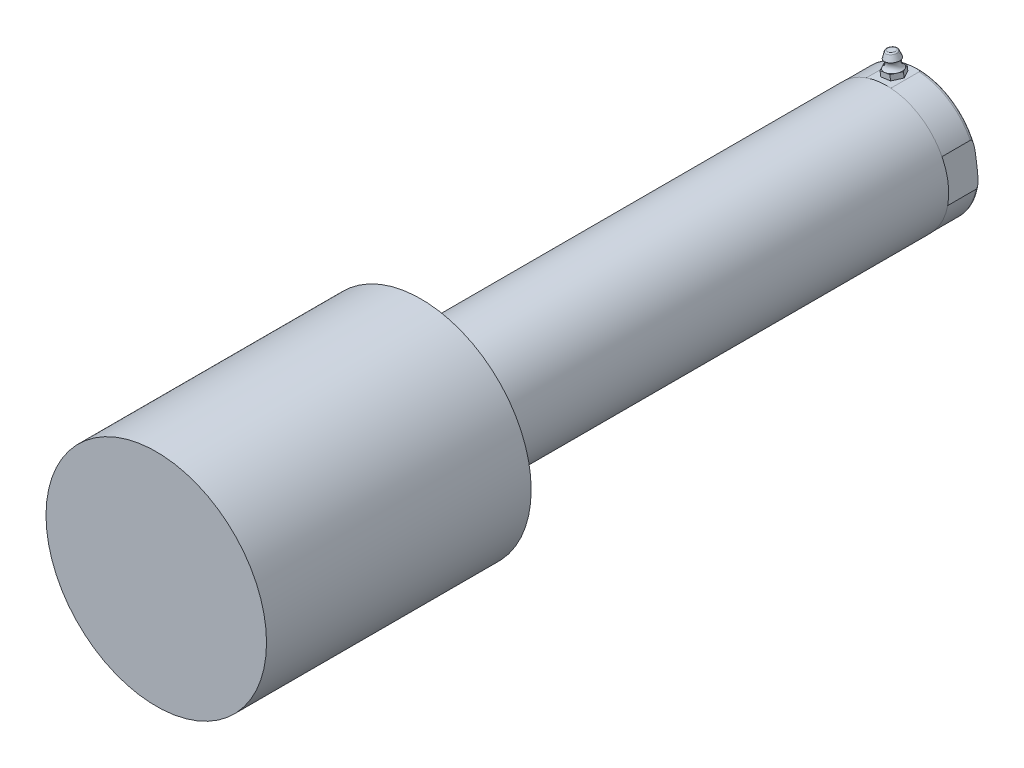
ISO-10303-21;
HEADER;
FILE_DESCRIPTION(('STEP AP214'),'2;1');
FILE_NAME('part.step','',(''),(''),'','','');
FILE_SCHEMA(('AUTOMOTIVE_DESIGN { 1 0 10303 214 1 1 1 1 }'));
ENDSEC;
DATA;
#1=APPLICATION_CONTEXT('core data for automotive mechanical design processes');
#2=APPLICATION_PROTOCOL_DEFINITION('international standard','automotive_design',2000,#1);
#3=PRODUCT_CONTEXT('',#1,'mechanical');
#4=PRODUCT('Part','Part','',(#3));
#5=PRODUCT_RELATED_PRODUCT_CATEGORY('part','',(#4));
#6=PRODUCT_DEFINITION_FORMATION('','',#4);
#7=PRODUCT_DEFINITION_CONTEXT('part definition',#1,'design');
#8=PRODUCT_DEFINITION('design','',#6,#7);
#9=PRODUCT_DEFINITION_SHAPE('','',#8);
#10=(LENGTH_UNIT() NAMED_UNIT(*) SI_UNIT(.MILLI.,.METRE.));
#11=(NAMED_UNIT(*) PLANE_ANGLE_UNIT() SI_UNIT($,.RADIAN.));
#12=(NAMED_UNIT(*) SI_UNIT($,.STERADIAN.) SOLID_ANGLE_UNIT());
#13=UNCERTAINTY_MEASURE_WITH_UNIT(LENGTH_MEASURE(1.E-05),#10,'distance_accuracy_value','');
#14=(GEOMETRIC_REPRESENTATION_CONTEXT(3) GLOBAL_UNCERTAINTY_ASSIGNED_CONTEXT((#13)) GLOBAL_UNIT_ASSIGNED_CONTEXT((#10,
#11,#12)) REPRESENTATION_CONTEXT('',''));
#15=CARTESIAN_POINT('',(0.,0.,0.));
#16=DIRECTION('',(0.,0.,1.));
#17=DIRECTION('',(1.,0.,0.));
#18=AXIS2_PLACEMENT_3D('',#15,#16,#17);
#19=CARTESIAN_POINT('',(-1.94212841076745,30.283054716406,-243.28755));
#20=DIRECTION('',(-0.139173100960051,0.990268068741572,0.));
#21=DIRECTION('',(0.495134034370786,0.0695865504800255,0.866025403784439));
#22=AXIS2_PLACEMENT_3D('',#19,#20,#21);
#23=PLANE('',#22);
#24=CARTESIAN_POINT('',(-4.21118794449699,29.9641591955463,-239.3188));
#25=DIRECTION('',(0.139173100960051,-0.990268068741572,0.));
#26=DIRECTION('',(0.857597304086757,0.120527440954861,-0.5));
#27=AXIS2_PLACEMENT_3D('',#24,#25,#26);
#28=CIRCLE('',#27,3.96875);
#29=CARTESIAN_POINT('',(-7.6147772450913,29.4858159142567,-237.334425));
#30=VERTEX_POINT('',#29);
#31=CARTESIAN_POINT('',(-7.6147772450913,29.4858159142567,-241.303175));
#32=VERTEX_POINT('',#31);
#33=EDGE_CURVE('E152',#30,#32,#28,.T.);
#34=ORIENTED_EDGE('',*,*,#33,.T.);
#35=DIRECTION('',(-0.495134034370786,-0.0695865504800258,0.866025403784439));
#36=VECTOR('',#35,1.);
#37=CARTESIAN_POINT('',(-6.48024747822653,29.6452636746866,-243.28755));
#38=LINE('',#37,#36);
#39=CARTESIAN_POINT('',(-8.74930701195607,29.3263681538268,-239.3188));
#40=VERTEX_POINT('',#39);
#41=EDGE_CURVE('E166',#32,#40,#38,.T.);
#42=ORIENTED_EDGE('',*,*,#41,.T.);
#43=DIRECTION('',(0.495134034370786,0.0695865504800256,0.866025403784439));
#44=VECTOR('',#43,1.);
#45=CARTESIAN_POINT('',(-8.74930701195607,29.3263681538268,-239.3188));
#46=LINE('',#45,#44);
#47=EDGE_CURVE('E159',#40,#30,#46,.T.);
#48=ORIENTED_EDGE('',*,*,#47,.T.);
#49=EDGE_LOOP('',(#34,#42,#48));
#50=FACE_BOUND('',#49,.T.);
#51=ADVANCED_FACE('F17',(#50),#23,.T.);
#52=CARTESIAN_POINT('',(-4.21118794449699,29.9641591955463,-235.35005));
#53=VERTEX_POINT('',#52);
#54=EDGE_CURVE('E141',#53,#30,#28,.T.);
#55=ORIENTED_EDGE('',*,*,#54,.T.);
#56=CARTESIAN_POINT('',(-6.48024747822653,29.6452636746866,-235.35005));
#57=VERTEX_POINT('',#56);
#58=EDGE_CURVE('E144',#30,#57,#46,.T.);
#59=ORIENTED_EDGE('',*,*,#58,.T.);
#60=DIRECTION('',(0.990268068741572,0.139173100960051,0.));
#61=VECTOR('',#60,1.);
#62=CARTESIAN_POINT('',(-6.48024747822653,29.6452636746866,-235.35005));
#63=LINE('',#62,#61);
#64=EDGE_CURVE('E147',#57,#53,#63,.T.);
#65=ORIENTED_EDGE('',*,*,#64,.T.);
#66=EDGE_LOOP('',(#55,#59,#65));
#67=FACE_BOUND('',#66,.T.);
#68=ADVANCED_FACE('F143',(#67),#23,.T.);
#69=CARTESIAN_POINT('',(-0.807598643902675,30.442502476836,-237.334425));
#70=VERTEX_POINT('',#69);
#71=EDGE_CURVE('E151',#70,#53,#28,.T.);
#72=ORIENTED_EDGE('',*,*,#71,.T.);
#73=CARTESIAN_POINT('',(-1.94212841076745,30.283054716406,-235.35005));
#74=VERTEX_POINT('',#73);
#75=EDGE_CURVE('E168',#53,#74,#63,.T.);
#76=ORIENTED_EDGE('',*,*,#75,.T.);
#77=DIRECTION('',(0.495134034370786,0.0695865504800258,-0.866025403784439));
#78=VECTOR('',#77,1.);
#79=CARTESIAN_POINT('',(-1.94212841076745,30.283054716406,-235.35005));
#80=LINE('',#79,#78);
#81=EDGE_CURVE('E187',#74,#70,#80,.T.);
#82=ORIENTED_EDGE('',*,*,#81,.T.);
#83=EDGE_LOOP('',(#72,#76,#82));
#84=FACE_BOUND('',#83,.T.);
#85=ADVANCED_FACE('F316',(#84),#23,.T.);
#86=CARTESIAN_POINT('',(-0.807598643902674,30.442502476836,-241.303175));
#87=VERTEX_POINT('',#86);
#88=EDGE_CURVE('E37',#87,#70,#28,.T.);
#89=ORIENTED_EDGE('',*,*,#88,.T.);
#90=CARTESIAN_POINT('',(0.326931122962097,30.6019502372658,-239.3188));
#91=VERTEX_POINT('',#90);
#92=EDGE_CURVE('E186',#70,#91,#80,.T.);
#93=ORIENTED_EDGE('',*,*,#92,.T.);
#94=DIRECTION('',(-0.495134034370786,-0.0695865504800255,-0.866025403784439));
#95=VECTOR('',#94,1.);
#96=CARTESIAN_POINT('',(0.326931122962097,30.6019502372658,-239.3188));
#97=LINE('',#96,#95);
#98=EDGE_CURVE('E177',#91,#87,#97,.T.);
#99=ORIENTED_EDGE('',*,*,#98,.T.);
#100=EDGE_LOOP('',(#89,#93,#99));
#101=FACE_BOUND('',#100,.T.);
#102=ADVANCED_FACE('F321',(#101),#23,.T.);
#103=CARTESIAN_POINT('',(-4.21118794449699,29.9641591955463,-243.28755));
#104=VERTEX_POINT('',#103);
#105=EDGE_CURVE('E172',#104,#87,#28,.T.);
#106=ORIENTED_EDGE('',*,*,#105,.T.);
#107=CARTESIAN_POINT('',(-1.94212841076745,30.283054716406,-243.28755));
#108=VERTEX_POINT('',#107);
#109=EDGE_CURVE('E180',#87,#108,#97,.T.);
#110=ORIENTED_EDGE('',*,*,#109,.T.);
#111=DIRECTION('',(-0.990268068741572,-0.139173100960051,0.));
#112=VECTOR('',#111,1.);
#113=CARTESIAN_POINT('',(-1.94212841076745,30.283054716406,-243.28755));
#114=LINE('',#113,#112);
#115=EDGE_CURVE('E181',#108,#104,#114,.T.);
#116=ORIENTED_EDGE('',*,*,#115,.T.);
#117=EDGE_LOOP('',(#106,#110,#116));
#118=FACE_BOUND('',#117,.T.);
#119=ADVANCED_FACE('F271',(#118),#23,.T.);
#120=CARTESIAN_POINT('',(0.326931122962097,30.6019502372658,-239.3188));
#121=DIRECTION('',(-0.857597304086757,-0.120527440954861,0.5));
#122=DIRECTION('',(0.139173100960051,-0.990268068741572,0.));
#123=AXIS2_PLACEMENT_3D('',#120,#121,#122);
#124=PLANE('',#123);
#125=DIRECTION('',(-0.495134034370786,-0.0695865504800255,-0.866025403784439));
#126=VECTOR('',#125,1.);
#127=CARTESIAN_POINT('',(0.65833706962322,28.2438743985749,-239.3188));
#128=LINE('',#127,#126);
#129=CARTESIAN_POINT('',(0.65833706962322,28.2438743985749,-239.3188));
#130=VERTEX_POINT('',#129);
#131=CARTESIAN_POINT('',(-1.61072246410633,27.9249788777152,-243.28755));
#132=VERTEX_POINT('',#131);
#133=EDGE_CURVE('E175',#130,#132,#128,.T.);
#134=ORIENTED_EDGE('',*,*,#133,.T.);
#135=DIRECTION('',(0.139173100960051,-0.990268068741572,0.));
#136=VECTOR('',#135,1.);
#137=CARTESIAN_POINT('',(-1.94212841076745,30.283054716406,-243.28755));
#138=LINE('',#137,#136);
#139=EDGE_CURVE('E214',#108,#132,#138,.T.);
#140=ORIENTED_EDGE('',*,*,#139,.F.);
#141=ORIENTED_EDGE('',*,*,#109,.F.);
#142=ORIENTED_EDGE('',*,*,#98,.F.);
#143=DIRECTION('',(0.139173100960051,-0.990268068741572,0.));
#144=VECTOR('',#143,1.);
#145=CARTESIAN_POINT('',(0.326931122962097,30.6019502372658,-239.3188));
#146=LINE('',#145,#144);
#147=EDGE_CURVE('E190',#91,#130,#146,.T.);
#148=ORIENTED_EDGE('',*,*,#147,.T.);
#149=EDGE_LOOP('',(#134,#140,#141,#142,#148));
#150=FACE_BOUND('',#149,.T.);
#151=ADVANCED_FACE('F267',(#150),#124,.F.);
#152=CARTESIAN_POINT('',(-1.94212841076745,30.283054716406,-243.28755));
#153=DIRECTION('',(0.,0.,1.));
#154=DIRECTION('',(0.990268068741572,0.139173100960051,0.));
#155=AXIS2_PLACEMENT_3D('',#152,#153,#154);
#156=PLANE('',#155);
#157=DIRECTION('',(-0.990268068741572,-0.139173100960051,0.));
#158=VECTOR('',#157,1.);
#159=CARTESIAN_POINT('',(-1.61072246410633,27.9249788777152,-243.28755));
#160=LINE('',#159,#158);
#161=CARTESIAN_POINT('',(-6.14884153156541,27.2871878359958,-243.28755));
#162=VERTEX_POINT('',#161);
#163=EDGE_CURVE('E193',#132,#162,#160,.T.);
#164=ORIENTED_EDGE('',*,*,#163,.T.);
#165=DIRECTION('',(0.139173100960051,-0.990268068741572,0.));
#166=VECTOR('',#165,1.);
#167=CARTESIAN_POINT('',(-6.48024747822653,29.6452636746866,-243.28755));
#168=LINE('',#167,#166);
#169=CARTESIAN_POINT('',(-6.48024747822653,29.6452636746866,-243.28755));
#170=VERTEX_POINT('',#169);
#171=EDGE_CURVE('E211',#170,#162,#168,.T.);
#172=ORIENTED_EDGE('',*,*,#171,.F.);
#173=EDGE_CURVE('E179',#104,#170,#114,.T.);
#174=ORIENTED_EDGE('',*,*,#173,.F.);
#175=ORIENTED_EDGE('',*,*,#115,.F.);
#176=ORIENTED_EDGE('',*,*,#139,.T.);
#177=EDGE_LOOP('',(#164,#172,#174,#175,#176));
#178=FACE_BOUND('',#177,.T.);
#179=ADVANCED_FACE('F270',(#178),#156,.F.);
#180=CARTESIAN_POINT('',(-6.48024747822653,29.6452636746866,-243.28755));
#181=DIRECTION('',(0.857597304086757,0.120527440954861,0.5));
#182=DIRECTION('',(0.495134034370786,0.0695865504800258,-0.866025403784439));
#183=AXIS2_PLACEMENT_3D('',#180,#181,#182);
#184=PLANE('',#183);
#185=DIRECTION('',(-0.495134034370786,-0.0695865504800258,0.866025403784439));
#186=VECTOR('',#185,1.);
#187=CARTESIAN_POINT('',(-6.14884153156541,27.2871878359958,-243.28755));
#188=LINE('',#187,#186);
#189=CARTESIAN_POINT('',(-8.41790106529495,26.968292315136,-239.3188));
#190=VERTEX_POINT('',#189);
#191=EDGE_CURVE('E195',#162,#190,#188,.T.);
#192=ORIENTED_EDGE('',*,*,#191,.T.);
#193=DIRECTION('',(0.139173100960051,-0.990268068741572,0.));
#194=VECTOR('',#193,1.);
#195=CARTESIAN_POINT('',(-8.74930701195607,29.3263681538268,-239.3188));
#196=LINE('',#195,#194);
#197=EDGE_CURVE('E209',#40,#190,#196,.T.);
#198=ORIENTED_EDGE('',*,*,#197,.F.);
#199=ORIENTED_EDGE('',*,*,#41,.F.);
#200=EDGE_CURVE('E97',#170,#32,#38,.T.);
#201=ORIENTED_EDGE('',*,*,#200,.F.);
#202=ORIENTED_EDGE('',*,*,#171,.T.);
#203=EDGE_LOOP('',(#192,#198,#199,#201,#202));
#204=FACE_BOUND('',#203,.T.);
#205=ADVANCED_FACE('F275',(#204),#184,.F.);
#206=CARTESIAN_POINT('',(-8.74930701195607,29.3263681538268,-239.3188));
#207=DIRECTION('',(0.857597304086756,0.120527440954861,-0.5));
#208=DIRECTION('',(-0.495134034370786,-0.0695865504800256,-0.866025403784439));
#209=AXIS2_PLACEMENT_3D('',#206,#207,#208);
#210=PLANE('',#209);
#211=DIRECTION('',(0.495134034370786,0.0695865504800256,0.866025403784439));
#212=VECTOR('',#211,1.);
#213=CARTESIAN_POINT('',(-8.41790106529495,26.968292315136,-239.3188));
#214=LINE('',#213,#212);
#215=CARTESIAN_POINT('',(-6.14884153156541,27.2871878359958,-235.35005));
#216=VERTEX_POINT('',#215);
#217=EDGE_CURVE('E197',#190,#216,#214,.T.);
#218=ORIENTED_EDGE('',*,*,#217,.T.);
#219=DIRECTION('',(0.139173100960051,-0.990268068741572,0.));
#220=VECTOR('',#219,1.);
#221=CARTESIAN_POINT('',(-6.48024747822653,29.6452636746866,-235.35005));
#222=LINE('',#221,#220);
#223=EDGE_CURVE('E161',#57,#216,#222,.T.);
#224=ORIENTED_EDGE('',*,*,#223,.F.);
#225=ORIENTED_EDGE('',*,*,#58,.F.);
#226=ORIENTED_EDGE('',*,*,#47,.F.);
#227=ORIENTED_EDGE('',*,*,#197,.T.);
#228=EDGE_LOOP('',(#218,#224,#225,#226,#227));
#229=FACE_BOUND('',#228,.T.);
#230=ADVANCED_FACE('F157',(#229),#210,.F.);
#231=CARTESIAN_POINT('',(-6.48024747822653,29.6452636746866,-235.35005));
#232=DIRECTION('',(0.,0.,-1.));
#233=DIRECTION('',(-0.990268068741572,-0.139173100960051,0.));
#234=AXIS2_PLACEMENT_3D('',#231,#232,#233);
#235=PLANE('',#234);
#236=DIRECTION('',(0.990268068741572,0.139173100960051,0.));
#237=VECTOR('',#236,1.);
#238=CARTESIAN_POINT('',(-6.14884153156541,27.2871878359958,-235.35005));
#239=LINE('',#238,#237);
#240=CARTESIAN_POINT('',(-1.61072246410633,27.9249788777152,-235.35005));
#241=VERTEX_POINT('',#240);
#242=EDGE_CURVE('E199',#216,#241,#239,.T.);
#243=ORIENTED_EDGE('',*,*,#242,.T.);
#244=DIRECTION('',(0.139173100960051,-0.990268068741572,0.));
#245=VECTOR('',#244,1.);
#246=CARTESIAN_POINT('',(-1.94212841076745,30.283054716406,-235.35005));
#247=LINE('',#246,#245);
#248=EDGE_CURVE('E205',#74,#241,#247,.T.);
#249=ORIENTED_EDGE('',*,*,#248,.F.);
#250=ORIENTED_EDGE('',*,*,#75,.F.);
#251=ORIENTED_EDGE('',*,*,#64,.F.);
#252=ORIENTED_EDGE('',*,*,#223,.T.);
#253=EDGE_LOOP('',(#243,#249,#250,#251,#252));
#254=FACE_BOUND('',#253,.T.);
#255=ADVANCED_FACE('F282',(#254),#235,.F.);
#256=CARTESIAN_POINT('',(-1.94212841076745,30.283054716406,-235.35005));
#257=DIRECTION('',(-0.857597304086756,-0.120527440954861,-0.5));
#258=DIRECTION('',(-0.495134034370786,-0.0695865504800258,0.866025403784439));
#259=AXIS2_PLACEMENT_3D('',#256,#257,#258);
#260=PLANE('',#259);
#261=DIRECTION('',(0.495134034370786,0.0695865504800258,-0.866025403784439));
#262=VECTOR('',#261,1.);
#263=CARTESIAN_POINT('',(-1.61072246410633,27.9249788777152,-235.35005));
#264=LINE('',#263,#262);
#265=EDGE_CURVE('E201',#241,#130,#264,.T.);
#266=ORIENTED_EDGE('',*,*,#265,.T.);
#267=ORIENTED_EDGE('',*,*,#147,.F.);
#268=ORIENTED_EDGE('',*,*,#92,.F.);
#269=ORIENTED_EDGE('',*,*,#81,.F.);
#270=ORIENTED_EDGE('',*,*,#248,.T.);
#271=EDGE_LOOP('',(#266,#267,#268,#269,#270));
#272=FACE_BOUND('',#271,.T.);
#273=ADVANCED_FACE('F285',(#272),#260,.F.);
#274=EDGE_CURVE('E171',#32,#104,#28,.T.);
#275=ORIENTED_EDGE('',*,*,#274,.T.);
#276=ORIENTED_EDGE('',*,*,#173,.T.);
#277=ORIENTED_EDGE('',*,*,#200,.T.);
#278=EDGE_LOOP('',(#275,#276,#277));
#279=FACE_BOUND('',#278,.T.);
#280=ADVANCED_FACE('F289',(#279),#23,.T.);
#281=CARTESIAN_POINT('',(-4.7259718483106,33.6270369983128,-239.3188));
#282=DIRECTION('',(0.139173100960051,-0.990268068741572,0.));
#283=DIRECTION('',(0.857597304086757,0.120527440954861,-0.5));
#284=AXIS2_PLACEMENT_3D('',#281,#282,#283);
#285=CONICAL_SURFACE('',#284,3.3655,0.340381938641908);
#286=CARTESIAN_POINT('',(-5.07952601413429,36.1427056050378,-239.3188));
#287=DIRECTION('',(-0.139173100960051,0.990268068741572,0.));
#288=DIRECTION('',(-0.857597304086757,-0.120527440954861,0.5));
#289=AXIS2_PLACEMENT_3D('',#286,#287,#288);
#290=CIRCLE('',#289,2.46577800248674);
#291=CARTESIAN_POINT('',(-2.96488144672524,36.4398995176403,-240.551689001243));
#292=VERTEX_POINT('',#291);
#293=EDGE_CURVE('E217',#292,#292,#290,.F.);
#294=CARTESIAN_POINT('',(-4.7259718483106,33.6270369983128,-239.3188));
#295=DIRECTION('',(0.139173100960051,-0.990268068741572,0.));
#296=DIRECTION('',(0.857597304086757,0.120527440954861,-0.5));
#297=AXIS2_PLACEMENT_3D('',#294,#295,#296);
#298=CIRCLE('',#297,3.3655);
#299=CARTESIAN_POINT('',(-1.83972812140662,34.0326721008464,-241.00155));
#300=VERTEX_POINT('',#299);
#301=EDGE_CURVE('E176',#300,#300,#298,.T.);
#302=CARTESIAN_POINT('',(-2.96488144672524,36.4398995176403,-240.551689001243));
#303=CARTESIAN_POINT('',(-2.95316109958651,36.4148242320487,-240.556375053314));
#304=CARTESIAN_POINT('',(-2.94144075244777,36.3897489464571,-240.561061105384));
#305=CARTESIAN_POINT('',(-2.9180000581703,36.3395983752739,-240.570433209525));
#306=CARTESIAN_POINT('',(-2.90627971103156,36.3145230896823,-240.575119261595));
#307=CARTESIAN_POINT('',(-2.88283901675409,36.2643725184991,-240.584491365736));
#308=CARTESIAN_POINT('',(-2.87111866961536,36.2392972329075,-240.589177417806));
#309=CARTESIAN_POINT('',(-2.84767797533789,36.1891466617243,-240.598549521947));
#310=CARTESIAN_POINT('',(-2.83595762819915,36.1640713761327,-240.603235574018));
#311=CARTESIAN_POINT('',(-2.81251693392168,36.1139208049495,-240.612607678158));
#312=CARTESIAN_POINT('',(-2.80079658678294,36.0888455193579,-240.617293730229));
#313=CARTESIAN_POINT('',(-2.77735589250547,36.0386949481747,-240.626665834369));
#314=CARTESIAN_POINT('',(-2.76563554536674,36.013619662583,-240.63135188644));
#315=CARTESIAN_POINT('',(-2.74219485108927,35.9634690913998,-240.640723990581));
#316=CARTESIAN_POINT('',(-2.73047450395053,35.9383938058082,-240.645410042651));
#317=CARTESIAN_POINT('',(-2.70703380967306,35.888243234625,-240.654782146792));
#318=CARTESIAN_POINT('',(-2.69531346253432,35.8631679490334,-240.659468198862));
#319=CARTESIAN_POINT('',(-2.67187276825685,35.8130173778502,-240.668840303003));
#320=CARTESIAN_POINT('',(-2.66015242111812,35.7879420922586,-240.673526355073));
#321=CARTESIAN_POINT('',(-2.63671172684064,35.7377915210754,-240.682898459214));
#322=CARTESIAN_POINT('',(-2.62499137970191,35.7127162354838,-240.687584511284));
#323=CARTESIAN_POINT('',(-2.60155068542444,35.6625656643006,-240.696956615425));
#324=CARTESIAN_POINT('',(-2.5898303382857,35.637490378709,-240.701642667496));
#325=CARTESIAN_POINT('',(-2.56638964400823,35.5873398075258,-240.711014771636));
#326=CARTESIAN_POINT('',(-2.55466929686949,35.5622645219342,-240.715700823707));
#327=CARTESIAN_POINT('',(-2.53122860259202,35.512113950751,-240.725072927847));
#328=CARTESIAN_POINT('',(-2.51950825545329,35.4870386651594,-240.729758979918));
#329=CARTESIAN_POINT('',(-2.49606756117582,35.4368880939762,-240.739131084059));
#330=CARTESIAN_POINT('',(-2.48434721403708,35.4118128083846,-240.743817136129));
#331=CARTESIAN_POINT('',(-2.46090651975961,35.3616622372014,-240.75318924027));
#332=CARTESIAN_POINT('',(-2.44918617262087,35.3365869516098,-240.75787529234));
#333=CARTESIAN_POINT('',(-2.4257454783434,35.2864363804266,-240.767247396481));
#334=CARTESIAN_POINT('',(-2.41402513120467,35.261361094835,-240.771933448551));
#335=CARTESIAN_POINT('',(-2.39058443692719,35.2112105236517,-240.781305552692));
#336=CARTESIAN_POINT('',(-2.37886408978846,35.1861352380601,-240.785991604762));
#337=CARTESIAN_POINT('',(-2.35542339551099,35.1359846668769,-240.795363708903));
#338=CARTESIAN_POINT('',(-2.34370304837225,35.1109093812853,-240.800049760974));
#339=CARTESIAN_POINT('',(-2.32026235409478,35.0607588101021,-240.809421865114));
#340=CARTESIAN_POINT('',(-2.30854200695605,35.0356835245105,-240.814107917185));
#341=CARTESIAN_POINT('',(-2.28510131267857,34.9855329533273,-240.823480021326));
#342=CARTESIAN_POINT('',(-2.27338096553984,34.9604576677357,-240.828166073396));
#343=CARTESIAN_POINT('',(-2.24994027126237,34.9103070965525,-240.837538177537));
#344=CARTESIAN_POINT('',(-2.23821992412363,34.8852318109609,-240.842224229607));
#345=CARTESIAN_POINT('',(-2.21477922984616,34.8350812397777,-240.851596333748));
#346=CARTESIAN_POINT('',(-2.20305888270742,34.8100059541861,-240.856282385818));
#347=CARTESIAN_POINT('',(-2.17961818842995,34.7598553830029,-240.865654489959));
#348=CARTESIAN_POINT('',(-2.16789784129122,34.7347800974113,-240.870340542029));
#349=CARTESIAN_POINT('',(-2.14445714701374,34.6846295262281,-240.87971264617));
#350=CARTESIAN_POINT('',(-2.13273679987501,34.6595542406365,-240.88439869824));
#351=CARTESIAN_POINT('',(-2.10929610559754,34.6094036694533,-240.893770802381));
#352=CARTESIAN_POINT('',(-2.0975757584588,34.5843283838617,-240.898456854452));
#353=CARTESIAN_POINT('',(-2.07413506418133,34.5341778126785,-240.907828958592));
#354=CARTESIAN_POINT('',(-2.06241471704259,34.5091025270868,-240.912515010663));
#355=CARTESIAN_POINT('',(-2.03897402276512,34.4589519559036,-240.921887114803));
#356=CARTESIAN_POINT('',(-2.02725367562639,34.433876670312,-240.926573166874));
#357=CARTESIAN_POINT('',(-2.00381298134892,34.3837260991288,-240.935945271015));
#358=CARTESIAN_POINT('',(-1.99209263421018,34.3586508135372,-240.940631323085));
#359=CARTESIAN_POINT('',(-1.96865193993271,34.308500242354,-240.950003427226));
#360=CARTESIAN_POINT('',(-1.95693159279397,34.2834249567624,-240.954689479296));
#361=CARTESIAN_POINT('',(-1.9334908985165,34.2332743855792,-240.964061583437));
#362=CARTESIAN_POINT('',(-1.92177055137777,34.2081990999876,-240.968747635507));
#363=CARTESIAN_POINT('',(-1.8983298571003,34.1580485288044,-240.978119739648));
#364=CARTESIAN_POINT('',(-1.88660950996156,34.1329732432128,-240.982805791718));
#365=CARTESIAN_POINT('',(-1.86316881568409,34.0828226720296,-240.992177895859));
#366=CARTESIAN_POINT('',(-1.85144846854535,34.057747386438,-240.99686394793));
#367=CARTESIAN_POINT('',(-1.83972812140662,34.0326721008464,-241.00155));
#368=B_SPLINE_CURVE_WITH_KNOTS('',3,(#302,#303,#304,#305,#306,#307,#308,#309,#310,#311,#312,
#313,#314,#315,#316,#317,#318,#319,#320,#321,#322,#323,#324,#325,#326,#327,#328,#329,#330,#331,
#332,#333,#334,#335,#336,#337,#338,#339,#340,#341,#342,#343,#344,#345,#346,#347,#348,#349,#350,
#351,#352,#353,#354,#355,#356,#357,#358,#359,#360,#361,#362,#363,#364,#365,#366,#367),
.UNSPECIFIED.,.F.,.F.,(4,2,2,2,2,2,2,2,2,2,2,2,2,2,2,2,2,2,2,2,2,2,2,2,2,2,2,2,2,2,2,2,4),(0.,
0.0842191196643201,0.16843823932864,0.252657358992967,0.336876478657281,0.421095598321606,
0.505314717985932,0.589533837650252,0.673752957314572,0.757972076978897,0.842191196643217,
0.926410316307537,1.01062943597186,1.09484855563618,1.17906767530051,1.26328679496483,
1.34750591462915,1.43172503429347,1.5159441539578,1.60016327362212,1.68438239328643,
1.76860151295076,1.85282063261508,1.93703975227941,2.02125887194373,2.10547799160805,
2.18969711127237,2.2739162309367,2.35813535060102,2.44235447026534,2.52657358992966,
2.61079270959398,2.6950118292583),.UNSPECIFIED.);
#369=EDGE_CURVE('BSEAM293',#292,#300,#368,.T.);
#370=ORIENTED_EDGE('',*,*,#293,.T.);
#371=ORIENTED_EDGE('',*,*,#301,.F.);
#372=ORIENTED_EDGE('',*,*,#369,.T.);
#373=ORIENTED_EDGE('',*,*,#369,.F.);
#374=EDGE_LOOP('',(#370,#372,#371,#373));
#375=FACE_BOUND('',#374,.T.);
#376=ADVANCED_FACE('F293',(#375),#285,.T.);
#377=CARTESIAN_POINT('',(-5.15017146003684,36.6453740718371,-239.3188));
#378=DIRECTION('',(-0.139173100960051,0.990268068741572,0.));
#379=DIRECTION('',(-0.857597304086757,-0.120527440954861,0.5));
#380=AXIS2_PLACEMENT_3D('',#377,#378,#379);
#381=PLANE('',#380);
#382=CARTESIAN_POINT('',(-5.15017146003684,36.6453740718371,-239.3188));
#383=DIRECTION('',(-0.139173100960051,0.990268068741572,0.));
#384=DIRECTION('',(-0.857597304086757,-0.120527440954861,0.5));
#385=AXIS2_PLACEMENT_3D('',#382,#383,#384);
#386=CIRCLE('',#385,1.7474960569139);
#387=CARTESIAN_POINT('',(-6.64881936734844,36.4347528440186,-238.445051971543));
#388=VERTEX_POINT('',#387);
#389=EDGE_CURVE('E28',#388,#388,#386,.T.);
#390=ORIENTED_EDGE('',*,*,#389,.T.);
#391=EDGE_LOOP('',(#390));
#392=FACE_BOUND('',#391,.T.);
#393=ADVANCED_FACE('F296',(#392),#381,.T.);
#394=CARTESIAN_POINT('',(-4.50353012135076,32.0442818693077,-239.3188));
#395=DIRECTION('',(0.139173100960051,-0.990268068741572,0.));
#396=DIRECTION('',(0.857597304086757,0.120527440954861,-0.5));
#397=AXIS2_PLACEMENT_3D('',#394,#395,#396);
#398=TOROIDAL_SURFACE('',#397,5.20693450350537,2.43833450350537);
#399=ORIENTED_EDGE('',*,*,#301,.T.);
#400=EDGE_LOOP('',(#399));
#401=FACE_BOUND('',#400,.T.);
#402=ORIENTED_EDGE('',*,*,#88,.F.);
#403=ORIENTED_EDGE('',*,*,#105,.F.);
#404=ORIENTED_EDGE('',*,*,#274,.F.);
#405=ORIENTED_EDGE('',*,*,#33,.F.);
#406=ORIENTED_EDGE('',*,*,#54,.F.);
#407=ORIENTED_EDGE('',*,*,#71,.F.);
#408=EDGE_LOOP('',(#402,#403,#404,#405,#406,#407));
#409=FACE_BOUND('',#408,.T.);
#410=ADVANCED_FACE('F169',(#401,#409),#398,.F.);
#411=CARTESIAN_POINT('',(-5.04412155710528,35.8907898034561,-239.3188));
#412=DIRECTION('',(-0.139173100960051,0.990268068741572,0.));
#413=DIRECTION('',(-0.857597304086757,-0.120527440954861,0.5));
#414=AXIS2_PLACEMENT_3D('',#411,#412,#413);
#415=TOROIDAL_SURFACE('',#414,1.7474960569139,0.762);
#416=ORIENTED_EDGE('',*,*,#389,.F.);
#417=EDGE_LOOP('',(#416));
#418=FACE_BOUND('',#417,.T.);
#419=ORIENTED_EDGE('',*,*,#293,.F.);
#420=EDGE_LOOP('',(#419));
#421=FACE_BOUND('',#420,.T.);
#422=ADVANCED_FACE('F260',(#418,#421),#415,.T.);
#423=CARTESIAN_POINT('',(0.,0.,-183.1848));
#424=DIRECTION('',(0.,0.,-1.));
#425=DIRECTION('',(0.139173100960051,-0.990268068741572,0.));
#426=AXIS2_PLACEMENT_3D('',#423,#424,#425);
#427=PLANE('',#426);
#428=CARTESIAN_POINT('',(0.,0.,-183.1848));
#429=DIRECTION('',(0.,0.,-1.));
#430=DIRECTION('',(0.139173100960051,-0.990268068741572,0.));
#431=AXIS2_PLACEMENT_3D('',#428,#429,#430);
#432=CIRCLE('',#431,14.8844);
#433=CARTESIAN_POINT('',(2.07150810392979,-14.7395460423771,-183.1848));
#434=VERTEX_POINT('',#433);
#435=EDGE_CURVE('E222',#434,#434,#432,.F.);
#436=ORIENTED_EDGE('',*,*,#435,.F.);
#437=EDGE_LOOP('',(#436));
#438=FACE_BOUND('',#437,.T.);
#439=ADVANCED_FACE('F256',(#438),#427,.T.);
#440=CARTESIAN_POINT('',(0.,0.,104.5718));
#441=DIRECTION('',(0.,0.,1.));
#442=DIRECTION('',(1.,0.,0.));
#443=AXIS2_PLACEMENT_3D('',#440,#441,#442);
#444=PLANE('',#443);
#445=CARTESIAN_POINT('',(0.,0.,104.5718));
#446=DIRECTION('',(0.,0.,1.));
#447=DIRECTION('',(1.,0.,0.));
#448=AXIS2_PLACEMENT_3D('',#445,#446,#447);
#449=CIRCLE('',#448,50.8);
#450=CARTESIAN_POINT('',(50.8,0.,104.5718));
#451=VERTEX_POINT('',#450);
#452=EDGE_CURVE('E351',#451,#451,#449,.T.);
#453=ORIENTED_EDGE('',*,*,#452,.T.);
#454=EDGE_LOOP('',(#453));
#455=FACE_BOUND('',#454,.T.);
#456=ADVANCED_FACE('F259',(#455),#444,.T.);
#457=CARTESIAN_POINT('',(0.,0.,-249.377012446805));
#458=DIRECTION('',(0.,0.,-1.));
#459=DIRECTION('',(0.139173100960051,-0.990268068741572,0.));
#460=AXIS2_PLACEMENT_3D('',#457,#458,#459);
#461=CYLINDRICAL_SURFACE('',#460,14.8844);
#462=ORIENTED_EDGE('',*,*,#435,.T.);
#463=EDGE_LOOP('',(#462));
#464=FACE_BOUND('',#463,.T.);
#465=CARTESIAN_POINT('',(0.,0.,-245.4148));
#466=DIRECTION('',(0.,0.,1.));
#467=DIRECTION('',(-0.139173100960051,0.990268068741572,0.));
#468=AXIS2_PLACEMENT_3D('',#465,#466,#467);
#469=CIRCLE('',#468,14.8844);
#470=CARTESIAN_POINT('',(-2.07150810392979,14.7395460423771,-245.4148));
#471=VERTEX_POINT('',#470);
#472=EDGE_CURVE('E452',#471,#471,#469,.F.);
#473=ORIENTED_EDGE('',*,*,#472,.T.);
#474=EDGE_LOOP('',(#473));
#475=FACE_BOUND('',#474,.T.);
#476=ADVANCED_FACE('F378',(#464,#475),#461,.F.);
#477=CARTESIAN_POINT('',(0.,0.,104.5718));
#478=DIRECTION('',(0.,0.,-1.));
#479=DIRECTION('',(-1.,0.,0.));
#480=AXIS2_PLACEMENT_3D('',#477,#478,#479);
#481=CYLINDRICAL_SURFACE('',#480,50.8);
#482=ORIENTED_EDGE('',*,*,#452,.F.);
#483=EDGE_LOOP('',(#482));
#484=FACE_BOUND('',#483,.T.);
#485=CARTESIAN_POINT('',(0.,0.,-17.3482));
#486=DIRECTION('',(0.,0.,1.));
#487=DIRECTION('',(1.,0.,0.));
#488=AXIS2_PLACEMENT_3D('',#485,#486,#487);
#489=CIRCLE('',#488,50.8);
#490=CARTESIAN_POINT('',(50.8,0.,-17.3482));
#491=VERTEX_POINT('',#490);
#492=EDGE_CURVE('E355',#491,#491,#489,.T.);
#493=ORIENTED_EDGE('',*,*,#492,.T.);
#494=EDGE_LOOP('',(#493));
#495=FACE_BOUND('',#494,.T.);
#496=ADVANCED_FACE('F376',(#484,#495),#481,.T.);
#497=CARTESIAN_POINT('',(0.,0.,-245.4148));
#498=DIRECTION('',(0.,0.,-1.));
#499=DIRECTION('',(0.139173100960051,-0.990268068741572,0.));
#500=AXIS2_PLACEMENT_3D('',#497,#498,#499);
#501=CONICAL_SURFACE('',#500,14.8844,0.785398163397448);
#502=CARTESIAN_POINT('',(0.,0.,-246.6848));
#503=DIRECTION('',(0.,0.,1.));
#504=DIRECTION('',(-0.139173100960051,0.990268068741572,0.));
#505=AXIS2_PLACEMENT_3D('',#502,#503,#504);
#506=CIRCLE('',#505,16.1544);
#507=CARTESIAN_POINT('',(-2.24825794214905,15.9971864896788,-246.6848));
#508=VERTEX_POINT('',#507);
#509=EDGE_CURVE('E347',#508,#508,#506,.T.);
#510=ORIENTED_EDGE('',*,*,#509,.F.);
#511=EDGE_LOOP('',(#510));
#512=FACE_BOUND('',#511,.T.);
#513=ORIENTED_EDGE('',*,*,#472,.F.);
#514=EDGE_LOOP('',(#513));
#515=FACE_BOUND('',#514,.T.);
#516=ADVANCED_FACE('F372',(#512,#515),#501,.F.);
#517=CARTESIAN_POINT('',(0.,0.,-17.3482));
#518=DIRECTION('',(0.,0.,1.));
#519=DIRECTION('',(1.,0.,0.));
#520=AXIS2_PLACEMENT_3D('',#517,#518,#519);
#521=PLANE('',#520);
#522=CARTESIAN_POINT('',(0.,0.,-17.3482));
#523=DIRECTION('',(0.,0.,1.));
#524=DIRECTION('',(1.,0.,0.));
#525=AXIS2_PLACEMENT_3D('',#522,#523,#524);
#526=CIRCLE('',#525,28.56738);
#527=CARTESIAN_POINT('',(28.56738,0.,-17.3482));
#528=VERTEX_POINT('',#527);
#529=EDGE_CURVE('E354',#528,#528,#526,.F.);
#530=ORIENTED_EDGE('',*,*,#529,.F.);
#531=EDGE_LOOP('',(#530));
#532=FACE_BOUND('',#531,.T.);
#533=ORIENTED_EDGE('',*,*,#492,.F.);
#534=EDGE_LOOP('',(#533));
#535=FACE_BOUND('',#534,.T.);
#536=ADVANCED_FACE('F367',(#532,#535),#521,.F.);
#537=CARTESIAN_POINT('',(-2.07150810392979,14.7395460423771,-246.6848));
#538=DIRECTION('',(0.,0.,1.));
#539=DIRECTION('',(-0.139173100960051,0.990268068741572,0.));
#540=AXIS2_PLACEMENT_3D('',#537,#538,#539);
#541=PLANE('',#540);
#542=ORIENTED_EDGE('',*,*,#509,.T.);
#543=EDGE_LOOP('',(#542));
#544=FACE_BOUND('',#543,.T.);
#545=CARTESIAN_POINT('',(0.,0.,-246.6848));
#546=DIRECTION('',(0.,0.,1.));
#547=DIRECTION('',(-0.139173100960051,0.990268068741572,0.));
#548=AXIS2_PLACEMENT_3D('',#545,#546,#547);
#549=CIRCLE('',#548,26.8732);
#550=CARTESIAN_POINT('',(-3.74002657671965,26.611671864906,-246.6848));
#551=VERTEX_POINT('',#550);
#552=EDGE_CURVE('E444',#551,#551,#549,.F.);
#553=ORIENTED_EDGE('',*,*,#552,.T.);
#554=EDGE_LOOP('',(#553));
#555=FACE_BOUND('',#554,.T.);
#556=ADVANCED_FACE('F266',(#544,#555),#541,.F.);
#557=CARTESIAN_POINT('',(0.,0.,8.89));
#558=DIRECTION('',(0.,0.,-1.));
#559=DIRECTION('',(-1.,0.,0.));
#560=AXIS2_PLACEMENT_3D('',#557,#558,#559);
#561=CYLINDRICAL_SURFACE('',#560,28.56738);
#562=CARTESIAN_POINT('',(0.,0.,-231.9528));
#563=DIRECTION('',(0.,0.,-1.));
#564=DIRECTION('',(-1.,0.,0.));
#565=AXIS2_PLACEMENT_3D('',#562,#563,#564);
#566=CIRCLE('',#565,28.56738);
#567=CARTESIAN_POINT('',(-28.56738,0.,-231.9528));
#568=VERTEX_POINT('',#567);
#569=EDGE_CURVE('E226',#568,#568,#566,.T.);
#570=ORIENTED_EDGE('',*,*,#569,.F.);
#571=EDGE_LOOP('',(#570));
#572=FACE_BOUND('',#571,.T.);
#573=ORIENTED_EDGE('',*,*,#529,.T.);
#574=EDGE_LOOP('',(#573));
#575=FACE_BOUND('',#574,.T.);
#576=ADVANCED_FACE('F363',(#572,#575),#561,.T.);
#577=CARTESIAN_POINT('',(0.,0.,-249.377012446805));
#578=DIRECTION('',(0.,0.,-1.));
#579=DIRECTION('',(0.139173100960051,-0.990268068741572,0.));
#580=AXIS2_PLACEMENT_3D('',#577,#578,#579);
#581=CYLINDRICAL_SURFACE('',#580,28.4607);
#582=CARTESIAN_POINT('',(0.,0.,-231.9528));
#583=DIRECTION('',(0.,0.,-1.));
#584=DIRECTION('',(0.139173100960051,-0.990268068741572,0.));
#585=AXIS2_PLACEMENT_3D('',#582,#583,#584);
#586=CIRCLE('',#585,28.4607);
#587=CARTESIAN_POINT('',(27.9459175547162,-5.38861174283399,-231.9528));
#588=VERTEX_POINT('',#587);
#589=CARTESIAN_POINT('',(-25.3780374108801,-12.8828048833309,-231.9528));
#590=VERTEX_POINT('',#589);
#591=EDGE_CURVE('E442',#588,#590,#586,.T.);
#592=ORIENTED_EDGE('',*,*,#591,.T.);
#593=DIRECTION('',(0.,0.,-1.));
#594=VECTOR('',#593,1.);
#595=CARTESIAN_POINT('',(-25.3780374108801,-12.8828048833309,-143.024189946));
#596=LINE('',#595,#594);
#597=CARTESIAN_POINT('',(-25.3780374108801,-12.8828048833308,-245.0973));
#598=VERTEX_POINT('',#597);
#599=EDGE_CURVE('E470',#590,#598,#596,.T.);
#600=ORIENTED_EDGE('',*,*,#599,.T.);
#601=CARTESIAN_POINT('',(0.,0.,-245.0973));
#602=DIRECTION('',(0.,0.,1.));
#603=DIRECTION('',(-0.139173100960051,0.990268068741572,0.));
#604=AXIS2_PLACEMENT_3D('',#601,#602,#603);
#605=CIRCLE('',#604,28.4607);
#606=CARTESIAN_POINT('',(27.9459175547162,-5.38861174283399,-245.0973));
#607=VERTEX_POINT('',#606);
#608=EDGE_CURVE('E448',#598,#607,#605,.T.);
#609=ORIENTED_EDGE('',*,*,#608,.T.);
#610=DIRECTION('',(0.,0.,-1.));
#611=VECTOR('',#610,1.);
#612=CARTESIAN_POINT('',(27.9459175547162,-5.38861174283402,-143.024189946));
#613=LINE('',#612,#611);
#614=EDGE_CURVE('E438',#588,#607,#613,.T.);
#615=ORIENTED_EDGE('',*,*,#614,.F.);
#616=EDGE_LOOP('',(#592,#600,#609,#615));
#617=FACE_BOUND('',#616,.T.);
#618=ADVANCED_FACE('F366',(#617),#581,.T.);
#619=CARTESIAN_POINT('',(-27.9459175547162,5.38861174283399,-143.024189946));
#620=DIRECTION('',(0.990268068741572,0.139173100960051,0.));
#621=DIRECTION('',(0.,0.,-1.));
#622=AXIS2_PLACEMENT_3D('',#619,#620,#621);
#623=PLANE('',#622);
#624=DIRECTION('',(-0.139173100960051,0.990268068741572,0.));
#625=VECTOR('',#624,1.);
#626=CARTESIAN_POINT('',(-27.9459175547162,5.38861174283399,-231.9528));
#627=LINE('',#626,#625);
#628=CARTESIAN_POINT('',(-27.9459175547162,5.38861174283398,-231.9528));
#629=VERTEX_POINT('',#628);
#630=EDGE_CURVE('E474',#590,#629,#627,.T.);
#631=ORIENTED_EDGE('',*,*,#630,.T.);
#632=DIRECTION('',(0.,0.,-1.));
#633=VECTOR('',#632,1.);
#634=CARTESIAN_POINT('',(-27.9459175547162,5.38861174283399,-143.024189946));
#635=LINE('',#634,#633);
#636=CARTESIAN_POINT('',(-27.9459175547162,5.38861174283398,-245.0973));
#637=VERTEX_POINT('',#636);
#638=EDGE_CURVE('E478',#629,#637,#635,.T.);
#639=ORIENTED_EDGE('',*,*,#638,.T.);
#640=CARTESIAN_POINT('',(-26.6619774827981,-3.74709657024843,-246.683986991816));
#641=CARTESIAN_POINT('',(-26.6987916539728,-3.48515013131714,-246.683987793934));
#642=CARTESIAN_POINT('',(-26.7356058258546,-3.22320368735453,-246.683876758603));
#643=CARTESIAN_POINT('',(-26.8092342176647,-2.69931045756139,-246.683262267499));
#644=CARTESIAN_POINT('',(-26.8460484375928,-2.43736367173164,-246.682758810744));
#645=CARTESIAN_POINT('',(-26.9196964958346,-1.91333050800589,-246.680842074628));
#646=CARTESIAN_POINT('',(-26.9565303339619,-1.65124413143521,-246.679428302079));
#647=CARTESIAN_POINT('',(-27.0301945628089,-1.12709590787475,-246.674827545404));
#648=CARTESIAN_POINT('',(-27.0670249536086,-0.86503406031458,-246.671640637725));
#649=CARTESIAN_POINT('',(-27.1407110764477,-0.340730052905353,-246.662265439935));
#650=CARTESIAN_POINT('',(-27.1775668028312,-0.0784879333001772,-246.656074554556));
#651=CARTESIAN_POINT('',(-27.2512563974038,0.44584077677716,-246.639046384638));
#652=CARTESIAN_POINT('',(-27.2880902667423,0.707927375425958,-246.628209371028));
#653=CARTESIAN_POINT('',(-27.3617399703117,1.23197224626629,-246.599716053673));
#654=CARTESIAN_POINT('',(-27.3985557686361,1.49393026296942,-246.582054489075));
#655=CARTESIAN_POINT('',(-27.4536877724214,1.88621485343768,-246.548191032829));
#656=CARTESIAN_POINT('',(-27.4720477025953,2.01685254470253,-246.535676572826));
#657=CARTESIAN_POINT('',(-27.5087233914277,2.27781363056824,-246.50768542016));
#658=CARTESIAN_POINT('',(-27.5270391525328,2.40813704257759,-246.492208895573));
#659=CARTESIAN_POINT('',(-27.5636756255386,2.6688190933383,-246.457623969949));
#660=CARTESIAN_POINT('',(-27.5819960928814,2.79917599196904,-246.438502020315));
#661=CARTESIAN_POINT('',(-27.6185434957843,3.05922427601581,-246.395875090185));
#662=CARTESIAN_POINT('',(-27.6367704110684,3.18891551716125,-246.372369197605));
#663=CARTESIAN_POINT('',(-27.6730228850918,3.44686527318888,-246.320007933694));
#664=CARTESIAN_POINT('',(-27.6910488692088,3.5751268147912,-246.291167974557));
#665=CARTESIAN_POINT('',(-27.7268597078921,3.82993417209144,-246.226677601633));
#666=CARTESIAN_POINT('',(-27.7446446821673,3.95648083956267,-246.191030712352));
#667=CARTESIAN_POINT('',(-27.7741735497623,4.16658964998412,-246.123651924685));
#668=CARTESIAN_POINT('',(-27.7860232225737,4.25090445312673,-246.0943393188));
#669=CARTESIAN_POINT('',(-27.8094835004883,4.4178330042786,-246.0304842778));
#670=CARTESIAN_POINT('',(-27.8210933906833,4.50044166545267,-245.995928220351));
#671=CARTESIAN_POINT('',(-27.8456127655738,4.67490608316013,-245.914555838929));
#672=CARTESIAN_POINT('',(-27.8584574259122,4.76630059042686,-245.8666792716));
#673=CARTESIAN_POINT('',(-27.8769387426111,4.89780199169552,-245.785894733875));
#674=CARTESIAN_POINT('',(-27.8829586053,4.94063554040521,-245.757527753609));
#675=CARTESIAN_POINT('',(-27.8946325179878,5.02369974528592,-245.697173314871));
#676=CARTESIAN_POINT('',(-27.9002870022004,5.06393349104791,-245.66519028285));
#677=CARTESIAN_POINT('',(-27.9099385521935,5.13260783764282,-245.603990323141));
#678=CARTESIAN_POINT('',(-27.914035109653,5.16175635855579,-245.575591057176));
#679=CARTESIAN_POINT('',(-27.9217678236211,5.21677747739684,-245.515610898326));
#680=CARTESIAN_POINT('',(-27.925403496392,5.24264663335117,-245.484026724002));
#681=CARTESIAN_POINT('',(-27.932058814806,5.29000168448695,-245.416962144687));
#682=CARTESIAN_POINT('',(-27.9350697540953,5.31142563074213,-245.381436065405));
#683=CARTESIAN_POINT('',(-27.9401266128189,5.347407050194,-245.307002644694));
#684=CARTESIAN_POINT('',(-27.9421756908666,5.36198699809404,-245.268106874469));
#685=CARTESIAN_POINT('',(-27.9446184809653,5.37936835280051,-245.199403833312));
#686=CARTESIAN_POINT('',(-27.9453172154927,5.38434010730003,-245.170157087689));
#687=CARTESIAN_POINT('',(-27.9460084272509,5.38925833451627,-245.111234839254));
#688=CARTESIAN_POINT('',(-27.9460012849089,5.38920751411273,-245.08155957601));
#689=CARTESIAN_POINT('',(-27.9452819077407,5.3840888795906,-245.022706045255));
#690=CARTESIAN_POINT('',(-27.9445706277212,5.37902785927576,-244.993527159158));
#691=CARTESIAN_POINT('',(-27.9425140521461,5.3643945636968,-244.936351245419));
#692=CARTESIAN_POINT('',(-27.9411681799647,5.35481818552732,-244.90835531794));
#693=CARTESIAN_POINT('',(-27.9372641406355,5.32703950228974,-244.842478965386));
#694=CARTESIAN_POINT('',(-27.9344339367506,5.3069015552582,-244.805436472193));
#695=CARTESIAN_POINT('',(-27.928002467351,5.2611392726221,-244.734999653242));
#696=CARTESIAN_POINT('',(-27.9243992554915,5.23550108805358,-244.701614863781));
#697=CARTESIAN_POINT('',(-27.913818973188,5.16021846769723,-244.614992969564));
#698=CARTESIAN_POINT('',(-27.9063067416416,5.106766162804,-244.56517050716));
#699=CARTESIAN_POINT('',(-27.8903994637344,4.99357999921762,-244.473551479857));
#700=CARTESIAN_POINT('',(-27.8820019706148,4.93382873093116,-244.431778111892));
#701=CARTESIAN_POINT('',(-27.8611562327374,4.78550359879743,-244.338676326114));
#702=CARTESIAN_POINT('',(-27.8484495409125,4.69509078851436,-244.290371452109));
#703=CARTESIAN_POINT('',(-27.8224562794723,4.51013912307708,-244.202472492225));
#704=CARTESIAN_POINT('',(-27.8091685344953,4.4155919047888,-244.162897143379));
#705=CARTESIAN_POINT('',(-27.7821829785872,4.22357969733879,-244.090230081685));
#706=CARTESIAN_POINT('',(-27.7684834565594,4.12610253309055,-244.057171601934));
#707=CARTESIAN_POINT('',(-27.7408777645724,3.92967782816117,-243.99637170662));
#708=CARTESIAN_POINT('',(-27.7269718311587,3.83073197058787,-243.968624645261));
#709=CARTESIAN_POINT('',(-27.699796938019,3.63737255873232,-243.918837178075));
#710=CARTESIAN_POINT('',(-27.6865361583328,3.5430172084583,-243.896563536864));
#711=CARTESIAN_POINT('',(-27.6599183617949,3.3536217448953,-243.855194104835));
#712=CARTESIAN_POINT('',(-27.6465613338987,3.25858155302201,-243.836098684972));
#713=CARTESIAN_POINT('',(-27.6063734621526,2.97262998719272,-243.78281432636));
#714=CARTESIAN_POINT('',(-27.5794392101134,2.78098282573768,-243.752650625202));
#715=CARTESIAN_POINT('',(-27.5253641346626,2.39621867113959,-243.700199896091));
#716=CARTESIAN_POINT('',(-27.4982229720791,2.20309926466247,-243.677931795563));
#717=CARTESIAN_POINT('',(-27.4438557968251,1.81625671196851,-243.639462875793));
#718=CARTESIAN_POINT('',(-27.4166297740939,1.62253349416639,-243.62326280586));
#719=CARTESIAN_POINT('',(-27.3620999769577,1.2345338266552,-243.595492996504));
#720=CARTESIAN_POINT('',(-27.3347961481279,1.04025698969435,-243.583928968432));
#721=CARTESIAN_POINT('',(-27.2801628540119,0.651520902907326,-243.564355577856));
#722=CARTESIAN_POINT('',(-27.2528333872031,0.457061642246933,-243.556346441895));
#723=CARTESIAN_POINT('',(-27.1982075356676,0.0683785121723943,-243.543010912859));
#724=CARTESIAN_POINT('',(-27.1709111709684,-0.125845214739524,-243.537680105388));
#725=CARTESIAN_POINT('',(-27.1163134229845,-0.514328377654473,-243.528975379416));
#726=CARTESIAN_POINT('',(-27.0890120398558,-0.708587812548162,-243.525601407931));
#727=CARTESIAN_POINT('',(-27.0080570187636,-1.28461271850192,-243.51760868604));
#728=CARTESIAN_POINT('',(-26.9543999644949,-1.66640249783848,-243.514931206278));
#729=CARTESIAN_POINT('',(-26.8470833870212,-2.42999962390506,-243.51167484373));
#730=CARTESIAN_POINT('',(-26.7934238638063,-2.81180697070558,-243.511096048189));
#731=CARTESIAN_POINT('',(-26.6860117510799,-3.57608386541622,-243.510522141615));
#732=CARTESIAN_POINT('',(-26.6322591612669,-3.95855341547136,-243.510528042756));
#733=CARTESIAN_POINT('',(-26.5247586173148,-4.72345953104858,-243.511153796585));
#734=CARTESIAN_POINT('',(-26.4710106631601,-5.10589609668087,-243.511773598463));
#735=CARTESIAN_POINT('',(-26.3631572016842,-5.87331335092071,-243.515215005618));
#736=CARTESIAN_POINT('',(-26.3090516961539,-6.25829402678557,-243.518051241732));
#737=CARTESIAN_POINT('',(-26.2278914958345,-6.83577885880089,-243.526437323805));
#738=CARTESIAN_POINT('',(-26.200832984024,-7.02831017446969,-243.529922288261));
#739=CARTESIAN_POINT('',(-26.1467224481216,-7.4133266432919,-243.538865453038));
#740=CARTESIAN_POINT('',(-26.1196704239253,-7.60581179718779,-243.544323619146));
#741=CARTESIAN_POINT('',(-26.0656677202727,-7.99006099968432,-243.55788913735));
#742=CARTESIAN_POINT('',(-26.03871699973,-8.18182534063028,-243.565987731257));
#743=CARTESIAN_POINT('',(-25.9848409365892,-8.56517344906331,-243.585697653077));
#744=CARTESIAN_POINT('',(-25.9579155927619,-8.75675722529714,-243.597308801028));
#745=CARTESIAN_POINT('',(-25.9041256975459,-9.13949221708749,-243.625109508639));
#746=CARTESIAN_POINT('',(-25.8772611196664,-9.33064362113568,-243.641296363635));
#747=CARTESIAN_POINT('',(-25.8236155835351,-9.71235144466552,-243.679621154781));
#748=CARTESIAN_POINT('',(-25.7968346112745,-9.9029079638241,-243.701758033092));
#749=CARTESIAN_POINT('',(-25.756495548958,-10.1899353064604,-243.741110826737));
#750=CARTESIAN_POINT('',(-25.7428826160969,-10.2867963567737,-243.755430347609));
#751=CARTESIAN_POINT('',(-25.7157074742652,-10.4801575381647,-243.78644658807));
#752=CARTESIAN_POINT('',(-25.7021452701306,-10.5766576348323,-243.803143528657));
#753=CARTESIAN_POINT('',(-25.6750439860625,-10.7694932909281,-243.839375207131));
#754=CARTESIAN_POINT('',(-25.6615051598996,-10.8658270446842,-243.858919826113));
#755=CARTESIAN_POINT('',(-25.6345291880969,-11.0577710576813,-243.901310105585));
#756=CARTESIAN_POINT('',(-25.6210920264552,-11.1533814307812,-243.924155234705));
#757=CARTESIAN_POINT('',(-25.5945695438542,-11.3420987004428,-243.973422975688));
#758=CARTESIAN_POINT('',(-25.5814820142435,-11.4352213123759,-243.999783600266));
#759=CARTESIAN_POINT('',(-25.5555085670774,-11.6200319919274,-244.057197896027));
#760=CARTESIAN_POINT('',(-25.5426225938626,-11.7117204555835,-244.088250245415));
#761=CARTESIAN_POINT('',(-25.5172158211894,-11.8924990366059,-244.156083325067));
#762=CARTESIAN_POINT('',(-25.5046935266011,-11.9815997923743,-244.192834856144));
#763=CARTESIAN_POINT('',(-25.4801359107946,-12.1563363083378,-244.273865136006));
#764=CARTESIAN_POINT('',(-25.4680997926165,-12.2419777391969,-244.318130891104));
#765=CARTESIAN_POINT('',(-25.4518226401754,-12.3577956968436,-244.387345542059));
#766=CARTESIAN_POINT('',(-25.4472274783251,-12.3904919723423,-244.408000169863));
#767=CARTESIAN_POINT('',(-25.4382109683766,-12.4546477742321,-244.451237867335));
#768=CARTESIAN_POINT('',(-25.4337897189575,-12.4861065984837,-244.473822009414));
#769=CARTESIAN_POINT('',(-25.4251959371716,-12.5472545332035,-244.521102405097));
#770=CARTESIAN_POINT('',(-25.4210225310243,-12.5769498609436,-244.545790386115));
#771=CARTESIAN_POINT('',(-25.4129901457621,-12.6341032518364,-244.59765726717));
#772=CARTESIAN_POINT('',(-25.4091308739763,-12.6615633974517,-244.624833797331));
#773=CARTESIAN_POINT('',(-25.40191419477,-12.7129127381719,-244.681444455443));
#774=CARTESIAN_POINT('',(-25.3985480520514,-12.7368640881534,-244.710820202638));
#775=CARTESIAN_POINT('',(-25.3923793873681,-12.7807564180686,-244.772570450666));
#776=CARTESIAN_POINT('',(-25.3895772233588,-12.8006948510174,-244.804946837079));
#777=CARTESIAN_POINT('',(-25.3847147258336,-12.8352933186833,-244.873142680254));
#778=CARTESIAN_POINT('',(-25.3826658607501,-12.849871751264,-244.909005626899));
#779=CARTESIAN_POINT('',(-25.3796229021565,-12.8715235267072,-244.982948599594));
#780=CARTESIAN_POINT('',(-25.3786256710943,-12.8786191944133,-245.021021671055));
#781=CARTESIAN_POINT('',(-25.3778966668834,-12.8838063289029,-245.092036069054));
#782=CARTESIAN_POINT('',(-25.377997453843,-12.8830891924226,-245.124890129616));
#783=CARTESIAN_POINT('',(-25.3790544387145,-12.8755683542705,-245.189889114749));
#784=CARTESIAN_POINT('',(-25.3800114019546,-12.8687592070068,-245.222033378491));
#785=CARTESIAN_POINT('',(-25.3828528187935,-12.8485414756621,-245.288896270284));
#786=CARTESIAN_POINT('',(-25.3848454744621,-12.834362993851,-245.323372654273));
#787=CARTESIAN_POINT('',(-25.3895762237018,-12.8007019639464,-245.389555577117));
#788=CARTESIAN_POINT('',(-25.3923155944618,-12.7812103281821,-245.421257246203));
#789=CARTESIAN_POINT('',(-25.4001402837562,-12.7255347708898,-245.499924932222));
#790=CARTESIAN_POINT('',(-25.4056491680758,-12.686337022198,-245.54468966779));
#791=CARTESIAN_POINT('',(-25.4175067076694,-12.6019662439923,-245.627992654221));
#792=CARTESIAN_POINT('',(-25.4238576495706,-12.5567769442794,-245.666513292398));
#793=CARTESIAN_POINT('',(-25.4373124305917,-12.4610412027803,-245.739705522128));
#794=CARTESIAN_POINT('',(-25.4444345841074,-12.4103644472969,-245.77420055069));
#795=CARTESIAN_POINT('',(-25.4590543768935,-12.3063392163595,-245.838854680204));
#796=CARTESIAN_POINT('',(-25.4665524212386,-12.2529878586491,-245.869008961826));
#797=CARTESIAN_POINT('',(-25.4818202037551,-12.1443519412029,-245.925817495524));
#798=CARTESIAN_POINT('',(-25.4895905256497,-12.0890632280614,-245.952463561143));
#799=CARTESIAN_POINT('',(-25.5053097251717,-11.9772153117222,-246.002763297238));
#800=CARTESIAN_POINT('',(-25.5132585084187,-11.9206567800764,-246.026418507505));
#801=CARTESIAN_POINT('',(-25.535199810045,-11.7645363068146,-246.08774292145));
#802=CARTESIAN_POINT('',(-25.5493286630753,-11.6640042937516,-246.12289031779));
#803=CARTESIAN_POINT('',(-25.5778436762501,-11.4611094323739,-246.187374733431));
#804=CARTESIAN_POINT('',(-25.5922299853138,-11.358745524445,-246.216708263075));
#805=CARTESIAN_POINT('',(-25.6211981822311,-11.1526260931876,-246.270756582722));
#806=CARTESIAN_POINT('',(-25.6357803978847,-11.0488682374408,-246.29546221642));
#807=CARTESIAN_POINT('',(-25.6650616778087,-10.8405211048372,-246.341026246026));
#808=CARTESIAN_POINT('',(-25.6797607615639,-10.7359316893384,-246.361883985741));
#809=CARTESIAN_POINT('',(-25.7241108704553,-10.4203642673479,-246.41984194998));
#810=CARTESIAN_POINT('',(-25.7538844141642,-10.2085144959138,-246.452097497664));
#811=CARTESIAN_POINT('',(-25.8135517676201,-9.78395921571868,-246.507309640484));
#812=CARTESIAN_POINT('',(-25.843445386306,-9.57125506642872,-246.53027753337));
#813=CARTESIAN_POINT('',(-25.906158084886,-9.12503102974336,-246.571206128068));
#814=CARTESIAN_POINT('',(-25.9389855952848,-8.89145115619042,-246.588484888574));
#815=CARTESIAN_POINT('',(-26.004691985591,-8.42392589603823,-246.617089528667));
#816=CARTESIAN_POINT('',(-26.0375708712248,-8.18998046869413,-246.628414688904));
#817=CARTESIAN_POINT('',(-26.1033748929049,-7.72176052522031,-246.646803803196));
#818=CARTESIAN_POINT('',(-26.1363000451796,-7.48748589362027,-246.653864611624));
#819=CARTESIAN_POINT('',(-26.2021602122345,-7.0188664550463,-246.665025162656));
#820=CARTESIAN_POINT('',(-26.2350952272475,-6.78452164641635,-246.669124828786));
#821=CARTESIAN_POINT('',(-26.3008635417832,-6.31655577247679,-246.675373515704));
#822=CARTESIAN_POINT('',(-26.3336968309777,-6.08293478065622,-246.677528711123));
#823=CARTESIAN_POINT('',(-26.399364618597,-5.61568419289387,-246.680678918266));
#824=CARTESIAN_POINT('',(-26.4321991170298,-5.38205459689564,-246.681673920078));
#825=CARTESIAN_POINT('',(-26.4978575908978,-4.91487027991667,-246.683048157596));
#826=CARTESIAN_POINT('',(-26.5306815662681,-4.68131555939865,-246.683427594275));
#827=CARTESIAN_POINT('',(-26.5963295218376,-4.21420608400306,-246.683896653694));
#828=CARTESIAN_POINT('',(-26.6291535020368,-3.98065132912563,-246.683986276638));
#829=CARTESIAN_POINT('',(-26.6619774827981,-3.74709657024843,-246.683986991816));
#830=B_SPLINE_CURVE_WITH_KNOTS('',3,(#640,#641,#642,#643,#644,#645,#646,#647,#648,#649,#650,
#651,#652,#653,#654,#655,#656,#657,#658,#659,#660,#661,#662,#663,#664,#665,#666,#667,#668,#669,
#670,#671,#672,#673,#674,#675,#676,#677,#678,#679,#680,#681,#682,#683,#684,#685,#686,#687,#688,
#689,#690,#691,#692,#693,#694,#695,#696,#697,#698,#699,#700,#701,#702,#703,#704,#705,#706,#707,
#708,#709,#710,#711,#712,#713,#714,#715,#716,#717,#718,#719,#720,#721,#722,#723,#724,#725,#726,
#727,#728,#729,#730,#731,#732,#733,#734,#735,#736,#737,#738,#739,#740,#741,#742,#743,#744,#745,
#746,#747,#748,#749,#750,#751,#752,#753,#754,#755,#756,#757,#758,#759,#760,#761,#762,#763,#764,
#765,#766,#767,#768,#769,#770,#771,#772,#773,#774,#775,#776,#777,#778,#779,#780,#781,#782,#783,
#784,#785,#786,#787,#788,#789,#790,#791,#792,#793,#794,#795,#796,#797,#798,#799,#800,#801,#802,
#803,#804,#805,#806,#807,#808,#809,#810,#811,#812,#813,#814,#815,#816,#817,#818,#819,#820,#821,
#822,#823,#824,#825,#826,#827,#828,#829),.UNSPECIFIED.,.T.,.F.,(4,2,2,2,2,2,2,2,2,2,2,2,2,2,2,2,
2,2,2,2,2,2,2,2,2,2,2,2,2,2,2,2,2,2,2,2,2,2,2,2,2,2,2,2,2,2,2,2,2,2,2,2,2,2,2,2,2,2,2,2,2,2,2,2,
2,2,2,2,2,2,2,2,2,2,2,2,2,2,2,2,2,2,2,2,2,2,2,2,2,2,2,2,2,2,4),(0.,0.793562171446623,
1.58712632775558,2.3811207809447,3.17508100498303,3.96972839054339,4.76432944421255,
5.55954425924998,5.95705955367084,6.35455229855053,6.75355222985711,7.15263526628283,
7.55058271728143,7.94832467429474,8.21833039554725,8.48904998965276,8.80019597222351,
8.95523940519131,9.1100950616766,9.23260448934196,9.35524145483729,9.47948711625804,
9.60332186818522,9.69194491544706,9.78052020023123,9.86897554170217,9.9575114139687,
10.0835606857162,10.2099311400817,10.4290574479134,10.6488061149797,10.957927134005,
11.2677053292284,11.5790245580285,11.8900110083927,12.1835009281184,12.4770250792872,
13.064369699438,13.6531129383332,14.2419288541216,14.8314679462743,15.4210446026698,
16.0096463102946,16.5982320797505,17.7548652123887,18.9115464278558,20.0702300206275,
21.228817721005,22.3951186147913,22.9784755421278,23.5618223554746,24.1432535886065,
24.7246550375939,25.305713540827,25.8866688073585,26.1832123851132,26.4797835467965,
26.7774094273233,27.0749874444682,27.3678803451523,27.6606908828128,27.9520479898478,
28.2429063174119,28.3596918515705,28.4765427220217,28.592953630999,28.7092548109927,
28.8231484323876,28.9371141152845,29.052749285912,29.1680384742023,29.2660272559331,
29.3641037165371,29.4754838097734,29.5870556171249,29.7653114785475,29.9440617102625,
30.128921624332,30.313985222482,30.4994732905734,30.6848654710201,31.0069036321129,
31.329134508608,31.6519963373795,31.974913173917,32.623634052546,33.2715634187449,
33.9809750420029,34.690472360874,35.4004924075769,36.110530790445,36.8183064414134,
37.526088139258,38.2336387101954,38.9411887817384),.UNSPECIFIED.);
#831=EDGE_CURVE('E485',#598,#637,#830,.T.);
#832=ORIENTED_EDGE('',*,*,#831,.F.);
#833=ORIENTED_EDGE('',*,*,#599,.F.);
#834=EDGE_LOOP('',(#631,#639,#832,#833));
#835=FACE_BOUND('',#834,.T.);
#836=ADVANCED_FACE('F424',(#835),#623,.F.);
#837=CARTESIAN_POINT('',(25.3780374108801,12.8828048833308,-143.024189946));
#838=DIRECTION('',(-0.990268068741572,-0.139173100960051,0.));
#839=DIRECTION('',(0.,0.,1.));
#840=AXIS2_PLACEMENT_3D('',#837,#838,#839);
#841=PLANE('',#840);
#842=DIRECTION('',(0.139173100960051,-0.990268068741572,0.));
#843=VECTOR('',#842,1.);
#844=CARTESIAN_POINT('',(25.3780374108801,12.8828048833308,-231.9528));
#845=LINE('',#844,#843);
#846=CARTESIAN_POINT('',(25.3780374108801,12.8828048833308,-231.9528));
#847=VERTEX_POINT('',#846);
#848=EDGE_CURVE('E436',#847,#588,#845,.T.);
#849=ORIENTED_EDGE('',*,*,#848,.T.);
#850=ORIENTED_EDGE('',*,*,#614,.T.);
#851=CARTESIAN_POINT('',(26.6619774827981,3.74709657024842,-246.683986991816));
#852=CARTESIAN_POINT('',(26.6987916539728,3.48515013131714,-246.683987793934));
#853=CARTESIAN_POINT('',(26.7356058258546,3.22320368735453,-246.683876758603));
#854=CARTESIAN_POINT('',(26.8092342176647,2.69931045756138,-246.683262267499));
#855=CARTESIAN_POINT('',(26.8460484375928,2.43736367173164,-246.682758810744));
#856=CARTESIAN_POINT('',(26.9196964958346,1.91333050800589,-246.680842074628));
#857=CARTESIAN_POINT('',(26.9565303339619,1.65124413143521,-246.679428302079));
#858=CARTESIAN_POINT('',(27.0301945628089,1.12709590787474,-246.674827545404));
#859=CARTESIAN_POINT('',(27.0670249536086,0.865034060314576,-246.671640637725));
#860=CARTESIAN_POINT('',(27.1407110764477,0.340730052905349,-246.662265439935));
#861=CARTESIAN_POINT('',(27.1775668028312,0.0784879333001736,-246.656074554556));
#862=CARTESIAN_POINT('',(27.2512563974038,-0.445840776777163,-246.639046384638));
#863=CARTESIAN_POINT('',(27.2880902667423,-0.707927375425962,-246.628209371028));
#864=CARTESIAN_POINT('',(27.3617399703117,-1.23197224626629,-246.599716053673));
#865=CARTESIAN_POINT('',(27.3985557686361,-1.49393026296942,-246.582054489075));
#866=CARTESIAN_POINT('',(27.4536877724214,-1.88621485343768,-246.548191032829));
#867=CARTESIAN_POINT('',(27.4720477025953,-2.01685254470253,-246.535676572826));
#868=CARTESIAN_POINT('',(27.5087233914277,-2.27781363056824,-246.50768542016));
#869=CARTESIAN_POINT('',(27.5270391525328,-2.40813704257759,-246.492208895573));
#870=CARTESIAN_POINT('',(27.5636756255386,-2.66881909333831,-246.457623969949));
#871=CARTESIAN_POINT('',(27.5819960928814,-2.79917599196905,-246.438502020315));
#872=CARTESIAN_POINT('',(27.6185434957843,-3.05922427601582,-246.395875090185));
#873=CARTESIAN_POINT('',(27.6367704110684,-3.18891551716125,-246.372369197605));
#874=CARTESIAN_POINT('',(27.6730228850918,-3.44686527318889,-246.320007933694));
#875=CARTESIAN_POINT('',(27.6910488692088,-3.5751268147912,-246.291167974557));
#876=CARTESIAN_POINT('',(27.7268597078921,-3.82993417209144,-246.226677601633));
#877=CARTESIAN_POINT('',(27.7446446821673,-3.95648083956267,-246.191030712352));
#878=CARTESIAN_POINT('',(27.7741735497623,-4.16658964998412,-246.123651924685));
#879=CARTESIAN_POINT('',(27.7860232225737,-4.25090445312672,-246.0943393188));
#880=CARTESIAN_POINT('',(27.8094835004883,-4.4178330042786,-246.0304842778));
#881=CARTESIAN_POINT('',(27.8210933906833,-4.50044166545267,-245.995928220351));
#882=CARTESIAN_POINT('',(27.8456127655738,-4.67490608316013,-245.914555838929));
#883=CARTESIAN_POINT('',(27.8584574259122,-4.76630059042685,-245.8666792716));
#884=CARTESIAN_POINT('',(27.8769387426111,-4.89780199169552,-245.785894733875));
#885=CARTESIAN_POINT('',(27.8829586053,-4.94063554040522,-245.757527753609));
#886=CARTESIAN_POINT('',(27.8946325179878,-5.02369974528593,-245.697173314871));
#887=CARTESIAN_POINT('',(27.9002870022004,-5.06393349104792,-245.66519028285));
#888=CARTESIAN_POINT('',(27.9099385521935,-5.13260783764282,-245.603990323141));
#889=CARTESIAN_POINT('',(27.914035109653,-5.16175635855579,-245.575591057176));
#890=CARTESIAN_POINT('',(27.9217678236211,-5.21677747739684,-245.515610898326));
#891=CARTESIAN_POINT('',(27.925403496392,-5.24264663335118,-245.484026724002));
#892=CARTESIAN_POINT('',(27.932058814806,-5.29000168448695,-245.416962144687));
#893=CARTESIAN_POINT('',(27.9350697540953,-5.31142563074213,-245.381436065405));
#894=CARTESIAN_POINT('',(27.9401266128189,-5.347407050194,-245.307002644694));
#895=CARTESIAN_POINT('',(27.9421756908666,-5.36198699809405,-245.268106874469));
#896=CARTESIAN_POINT('',(27.9446184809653,-5.37936835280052,-245.199403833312));
#897=CARTESIAN_POINT('',(27.9453172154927,-5.38434010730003,-245.170157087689));
#898=CARTESIAN_POINT('',(27.9460084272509,-5.38925833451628,-245.111234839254));
#899=CARTESIAN_POINT('',(27.9460012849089,-5.38920751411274,-245.08155957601));
#900=CARTESIAN_POINT('',(27.9452819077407,-5.3840888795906,-245.022706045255));
#901=CARTESIAN_POINT('',(27.9445706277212,-5.37902785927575,-244.993527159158));
#902=CARTESIAN_POINT('',(27.9425140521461,-5.36439456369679,-244.936351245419));
#903=CARTESIAN_POINT('',(27.9411681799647,-5.35481818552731,-244.90835531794));
#904=CARTESIAN_POINT('',(27.9372641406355,-5.32703950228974,-244.842478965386));
#905=CARTESIAN_POINT('',(27.9344339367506,-5.3069015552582,-244.805436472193));
#906=CARTESIAN_POINT('',(27.928002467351,-5.2611392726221,-244.734999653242));
#907=CARTESIAN_POINT('',(27.9243992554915,-5.23550108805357,-244.701614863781));
#908=CARTESIAN_POINT('',(27.913818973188,-5.16021846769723,-244.614992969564));
#909=CARTESIAN_POINT('',(27.9063067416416,-5.106766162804,-244.56517050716));
#910=CARTESIAN_POINT('',(27.8903994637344,-4.99357999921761,-244.473551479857));
#911=CARTESIAN_POINT('',(27.8820019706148,-4.93382873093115,-244.431778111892));
#912=CARTESIAN_POINT('',(27.8611562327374,-4.7855035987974,-244.338676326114));
#913=CARTESIAN_POINT('',(27.8484495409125,-4.69509078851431,-244.290371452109));
#914=CARTESIAN_POINT('',(27.8224562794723,-4.510139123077,-244.202472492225));
#915=CARTESIAN_POINT('',(27.8091685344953,-4.4155919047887,-244.162897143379));
#916=CARTESIAN_POINT('',(27.7821829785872,-4.22357969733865,-244.090230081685));
#917=CARTESIAN_POINT('',(27.7684834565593,-4.12610253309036,-244.057171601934));
#918=CARTESIAN_POINT('',(27.7408777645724,-3.92967782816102,-243.99637170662));
#919=CARTESIAN_POINT('',(27.7269718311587,-3.83073197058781,-243.96862464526));
#920=CARTESIAN_POINT('',(27.699796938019,-3.63737255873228,-243.918837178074));
#921=CARTESIAN_POINT('',(27.6865361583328,-3.5430172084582,-243.896563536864));
#922=CARTESIAN_POINT('',(27.6599183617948,-3.35362174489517,-243.855194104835));
#923=CARTESIAN_POINT('',(27.6465613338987,-3.25858155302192,-243.836098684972));
#924=CARTESIAN_POINT('',(27.6063734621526,-2.97262998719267,-243.78281432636));
#925=CARTESIAN_POINT('',(27.5794392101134,-2.78098282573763,-243.752650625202));
#926=CARTESIAN_POINT('',(27.5253641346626,-2.39621867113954,-243.700199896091));
#927=CARTESIAN_POINT('',(27.4982229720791,-2.20309926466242,-243.677931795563));
#928=CARTESIAN_POINT('',(27.4438557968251,-1.81625671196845,-243.639462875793));
#929=CARTESIAN_POINT('',(27.4166297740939,-1.62253349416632,-243.62326280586));
#930=CARTESIAN_POINT('',(27.3620999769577,-1.23453382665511,-243.595492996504));
#931=CARTESIAN_POINT('',(27.3347961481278,-1.04025698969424,-243.583928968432));
#932=CARTESIAN_POINT('',(27.2801628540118,-0.651520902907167,-243.564355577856));
#933=CARTESIAN_POINT('',(27.252833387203,-0.457061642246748,-243.556346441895));
#934=CARTESIAN_POINT('',(27.1982075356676,-0.0683785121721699,-243.543010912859));
#935=CARTESIAN_POINT('',(27.1709111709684,0.125845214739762,-243.537680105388));
#936=CARTESIAN_POINT('',(27.1163134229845,0.514328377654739,-243.528975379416));
#937=CARTESIAN_POINT('',(27.0890120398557,0.708587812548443,-243.525601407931));
#938=CARTESIAN_POINT('',(27.0080570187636,1.28461271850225,-243.51760868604));
#939=CARTESIAN_POINT('',(26.9543999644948,1.66640249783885,-243.514931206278));
#940=CARTESIAN_POINT('',(26.8470833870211,2.42999962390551,-243.51167484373));
#941=CARTESIAN_POINT('',(26.7934238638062,2.81180697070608,-243.511096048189));
#942=CARTESIAN_POINT('',(26.6860117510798,3.57608386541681,-243.510522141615));
#943=CARTESIAN_POINT('',(26.6322591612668,3.95855341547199,-243.510528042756));
#944=CARTESIAN_POINT('',(26.5247586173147,4.72345953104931,-243.511153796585));
#945=CARTESIAN_POINT('',(26.47101066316,5.10589609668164,-243.511773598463));
#946=CARTESIAN_POINT('',(26.3631572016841,5.87331335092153,-243.515215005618));
#947=CARTESIAN_POINT('',(26.3090516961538,6.25829402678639,-243.518051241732));
#948=CARTESIAN_POINT('',(26.2278914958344,6.8357788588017,-243.526437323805));
#949=CARTESIAN_POINT('',(26.2008329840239,7.02831017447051,-243.529922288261));
#950=CARTESIAN_POINT('',(26.1467224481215,7.41332664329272,-243.538865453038));
#951=CARTESIAN_POINT('',(26.1196704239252,7.6058117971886,-243.544323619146));
#952=CARTESIAN_POINT('',(26.0656677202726,7.99006099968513,-243.55788913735));
#953=CARTESIAN_POINT('',(26.0387169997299,8.18182534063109,-243.565987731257));
#954=CARTESIAN_POINT('',(25.9848409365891,8.56517344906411,-243.585697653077));
#955=CARTESIAN_POINT('',(25.9579155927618,8.75675722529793,-243.597308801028));
#956=CARTESIAN_POINT('',(25.9041256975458,9.13949221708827,-243.625109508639));
#957=CARTESIAN_POINT('',(25.8772611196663,9.33064362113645,-243.641296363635));
#958=CARTESIAN_POINT('',(25.823615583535,9.71235144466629,-243.679621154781));
#959=CARTESIAN_POINT('',(25.7968346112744,9.90290796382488,-243.701758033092));
#960=CARTESIAN_POINT('',(25.7564955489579,10.1899353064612,-243.741110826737));
#961=CARTESIAN_POINT('',(25.7428826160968,10.2867963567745,-243.755430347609));
#962=CARTESIAN_POINT('',(25.7157074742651,10.4801575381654,-243.78644658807));
#963=CARTESIAN_POINT('',(25.7021452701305,10.576657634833,-243.803143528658));
#964=CARTESIAN_POINT('',(25.6750439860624,10.7694932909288,-243.839375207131));
#965=CARTESIAN_POINT('',(25.6615051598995,10.8658270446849,-243.858919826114));
#966=CARTESIAN_POINT('',(25.6345291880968,11.057771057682,-243.901310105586));
#967=CARTESIAN_POINT('',(25.6210920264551,11.1533814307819,-243.924155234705));
#968=CARTESIAN_POINT('',(25.5945695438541,11.3420987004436,-243.973422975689));
#969=CARTESIAN_POINT('',(25.5814820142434,11.4352213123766,-243.999783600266));
#970=CARTESIAN_POINT('',(25.5555085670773,11.6200319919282,-244.057197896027));
#971=CARTESIAN_POINT('',(25.5426225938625,11.7117204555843,-244.088250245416));
#972=CARTESIAN_POINT('',(25.5172158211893,11.8924990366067,-244.156083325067));
#973=CARTESIAN_POINT('',(25.504693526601,11.9815997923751,-244.192834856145));
#974=CARTESIAN_POINT('',(25.4801359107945,12.1563363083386,-244.273865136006));
#975=CARTESIAN_POINT('',(25.4680997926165,12.2419777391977,-244.318130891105));
#976=CARTESIAN_POINT('',(25.4518226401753,12.3577956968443,-244.387345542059));
#977=CARTESIAN_POINT('',(25.447227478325,12.390491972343,-244.408000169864));
#978=CARTESIAN_POINT('',(25.4382109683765,12.4546477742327,-244.451237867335));
#979=CARTESIAN_POINT('',(25.4337897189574,12.4861065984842,-244.473822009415));
#980=CARTESIAN_POINT('',(25.4251959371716,12.5472545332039,-244.521102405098));
#981=CARTESIAN_POINT('',(25.4210225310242,12.5769498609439,-244.545790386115));
#982=CARTESIAN_POINT('',(25.4129901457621,12.6341032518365,-244.59765726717));
#983=CARTESIAN_POINT('',(25.4091308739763,12.6615633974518,-244.624833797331));
#984=CARTESIAN_POINT('',(25.40191419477,12.712912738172,-244.681444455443));
#985=CARTESIAN_POINT('',(25.3985480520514,12.7368640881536,-244.710820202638));
#986=CARTESIAN_POINT('',(25.3923793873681,12.7807564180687,-244.772570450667));
#987=CARTESIAN_POINT('',(25.3895772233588,12.8006948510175,-244.804946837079));
#988=CARTESIAN_POINT('',(25.3847147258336,12.8352933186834,-244.873142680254));
#989=CARTESIAN_POINT('',(25.3826658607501,12.8498717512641,-244.909005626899));
#990=CARTESIAN_POINT('',(25.3796229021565,12.8715235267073,-244.982948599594));
#991=CARTESIAN_POINT('',(25.3786256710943,12.8786191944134,-245.021021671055));
#992=CARTESIAN_POINT('',(25.3778966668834,12.8838063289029,-245.092036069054));
#993=CARTESIAN_POINT('',(25.377997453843,12.8830891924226,-245.124890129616));
#994=CARTESIAN_POINT('',(25.3790544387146,12.8755683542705,-245.189889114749));
#995=CARTESIAN_POINT('',(25.3800114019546,12.8687592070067,-245.222033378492));
#996=CARTESIAN_POINT('',(25.3828528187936,12.8485414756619,-245.288896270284));
#997=CARTESIAN_POINT('',(25.3848454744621,12.8343629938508,-245.323372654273));
#998=CARTESIAN_POINT('',(25.3895762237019,12.8007019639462,-245.389555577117));
#999=CARTESIAN_POINT('',(25.3923155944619,12.781210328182,-245.421257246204));
#1000=CARTESIAN_POINT('',(25.4001402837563,12.7255347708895,-245.499924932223));
#1001=CARTESIAN_POINT('',(25.4056491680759,12.6863370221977,-245.54468966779));
#1002=CARTESIAN_POINT('',(25.4175067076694,12.6019662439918,-245.627992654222));
#1003=CARTESIAN_POINT('',(25.4238576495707,12.5567769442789,-245.666513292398));
#1004=CARTESIAN_POINT('',(25.4373124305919,12.4610412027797,-245.739705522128));
#1005=CARTESIAN_POINT('',(25.4444345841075,12.4103644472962,-245.77420055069));
#1006=CARTESIAN_POINT('',(25.4590543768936,12.3063392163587,-245.838854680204));
#1007=CARTESIAN_POINT('',(25.4665524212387,12.2529878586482,-245.869008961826));
#1008=CARTESIAN_POINT('',(25.4818202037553,12.1443519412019,-245.925817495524));
#1009=CARTESIAN_POINT('',(25.4895905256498,12.0890632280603,-245.952463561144));
#1010=CARTESIAN_POINT('',(25.5053097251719,11.977215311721,-246.002763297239));
#1011=CARTESIAN_POINT('',(25.5132585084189,11.9206567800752,-246.026418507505));
#1012=CARTESIAN_POINT('',(25.5351998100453,11.7645363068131,-246.08774292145));
#1013=CARTESIAN_POINT('',(25.5493286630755,11.6640042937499,-246.122890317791));
#1014=CARTESIAN_POINT('',(25.5778436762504,11.461109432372,-246.187374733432));
#1015=CARTESIAN_POINT('',(25.5922299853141,11.3587455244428,-246.216708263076));
#1016=CARTESIAN_POINT('',(25.6211981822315,11.1526260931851,-246.270756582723));
#1017=CARTESIAN_POINT('',(25.6357803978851,11.0488682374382,-246.295462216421));
#1018=CARTESIAN_POINT('',(25.6650616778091,10.8405211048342,-246.341026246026));
#1019=CARTESIAN_POINT('',(25.6797607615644,10.7359316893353,-246.361883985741));
#1020=CARTESIAN_POINT('',(25.7241108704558,10.4203642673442,-246.41984194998));
#1021=CARTESIAN_POINT('',(25.7538844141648,10.2085144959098,-246.452097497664));
#1022=CARTESIAN_POINT('',(25.8135517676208,9.78395921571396,-246.507309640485));
#1023=CARTESIAN_POINT('',(25.8434453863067,9.57125506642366,-246.530277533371));
#1024=CARTESIAN_POINT('',(25.9061580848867,9.12503102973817,-246.571206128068));
#1025=CARTESIAN_POINT('',(25.9389855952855,8.89145115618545,-246.588484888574));
#1026=CARTESIAN_POINT('',(26.0046919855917,8.42392589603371,-246.617089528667));
#1027=CARTESIAN_POINT('',(26.0375708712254,8.18998046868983,-246.628414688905));
#1028=CARTESIAN_POINT('',(26.1033748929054,7.72176052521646,-246.646803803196));
#1029=CARTESIAN_POINT('',(26.1363000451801,7.48748589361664,-246.653864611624));
#1030=CARTESIAN_POINT('',(26.202160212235,7.01886645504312,-246.665025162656));
#1031=CARTESIAN_POINT('',(26.2350952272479,6.78452164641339,-246.669124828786));
#1032=CARTESIAN_POINT('',(26.3008635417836,6.31655577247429,-246.675373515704));
#1033=CARTESIAN_POINT('',(26.333696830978,6.08293478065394,-246.677528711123));
#1034=CARTESIAN_POINT('',(26.3993646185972,5.61568419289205,-246.680678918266));
#1035=CARTESIAN_POINT('',(26.43219911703,5.38205459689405,-246.681673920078));
#1036=CARTESIAN_POINT('',(26.497857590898,4.91487027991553,-246.683048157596));
#1037=CARTESIAN_POINT('',(26.5306815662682,4.68131555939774,-246.683427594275));
#1038=CARTESIAN_POINT('',(26.5963295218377,4.2142060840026,-246.683896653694));
#1039=CARTESIAN_POINT('',(26.6291535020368,3.9806513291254,-246.683986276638));
#1040=CARTESIAN_POINT('',(26.6619774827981,3.74709657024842,-246.683986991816));
#1041=B_SPLINE_CURVE_WITH_KNOTS('',3,(#851,#852,#853,#854,#855,#856,#857,#858,#859,#860,#861,
#862,#863,#864,#865,#866,#867,#868,#869,#870,#871,#872,#873,#874,#875,#876,#877,#878,#879,#880,
#881,#882,#883,#884,#885,#886,#887,#888,#889,#890,#891,#892,#893,#894,#895,#896,#897,#898,#899,
#900,#901,#902,#903,#904,#905,#906,#907,#908,#909,#910,#911,#912,#913,#914,#915,#916,#917,#918,
#919,#920,#921,#922,#923,#924,#925,#926,#927,#928,#929,#930,#931,#932,#933,#934,#935,#936,#937,
#938,#939,#940,#941,#942,#943,#944,#945,#946,#947,#948,#949,#950,#951,#952,#953,#954,#955,#956,
#957,#958,#959,#960,#961,#962,#963,#964,#965,#966,#967,#968,#969,#970,#971,#972,#973,#974,#975,
#976,#977,#978,#979,#980,#981,#982,#983,#984,#985,#986,#987,#988,#989,#990,#991,#992,#993,#994,
#995,#996,#997,#998,#999,#1000,#1001,#1002,#1003,#1004,#1005,#1006,#1007,#1008,#1009,#1010,
#1011,#1012,#1013,#1014,#1015,#1016,#1017,#1018,#1019,#1020,#1021,#1022,#1023,#1024,#1025,#1026,
#1027,#1028,#1029,#1030,#1031,#1032,#1033,#1034,#1035,#1036,#1037,#1038,#1039,#1040),
.UNSPECIFIED.,.T.,.F.,(4,2,2,2,2,2,2,2,2,2,2,2,2,2,2,2,2,2,2,2,2,2,2,2,2,2,2,2,2,2,2,2,2,2,2,2,
2,2,2,2,2,2,2,2,2,2,2,2,2,2,2,2,2,2,2,2,2,2,2,2,2,2,2,2,2,2,2,2,2,2,2,2,2,2,2,2,2,2,2,2,2,2,2,2,
2,2,2,2,2,2,2,2,2,2,4),(0.,0.793562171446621,1.58712632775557,2.3811207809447,3.17508100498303,
3.96972839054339,4.76432944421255,5.55954425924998,5.95705955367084,6.35455229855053,
6.75355222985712,7.15263526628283,7.55058271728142,7.94832467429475,8.21833039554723,
8.48904998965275,8.8001959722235,8.95523940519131,9.11009506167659,9.23260448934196,
9.35524145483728,9.47948711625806,9.60332186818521,9.69194491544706,9.78052020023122,
9.86897554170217,9.9575114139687,10.0835606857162,10.2099311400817,10.4290574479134,
10.6488061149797,10.957927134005,11.2677053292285,11.5790245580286,11.8900110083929,
12.1835009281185,12.4770250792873,13.0643696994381,13.6531129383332,14.2419288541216,
14.8314679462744,15.42104460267,16.0096463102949,16.5982320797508,17.7548652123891,
18.9115464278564,20.0702300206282,21.2288177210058,22.3951186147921,22.9784755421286,
23.5618223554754,24.1432535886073,24.7246550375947,25.3057135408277,25.8866688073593,
26.1832123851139,26.4797835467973,26.7774094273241,27.0749874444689,27.3678803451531,
27.6606908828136,27.9520479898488,28.2429063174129,28.3596918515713,28.4765427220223,
28.5929536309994,28.7092548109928,28.8231484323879,28.937114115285,29.0527492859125,
29.1680384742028,29.2660272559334,29.3641037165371,29.4754838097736,29.5870556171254,
29.7653114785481,29.9440617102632,30.1289216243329,30.3139852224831,30.4994732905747,
30.6848654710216,31.0069036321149,31.3291345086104,31.6519963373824,31.9749131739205,
32.6236340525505,33.2715634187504,33.9809750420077,34.6904723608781,35.4004924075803,
36.1105307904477,36.8183064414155,37.5260881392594,38.2336387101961,38.9411887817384),.UNSPECIFIED.);
#1042=CARTESIAN_POINT('',(25.3780374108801,12.8828048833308,-245.0973));
#1043=VERTEX_POINT('',#1042);
#1044=EDGE_CURVE('E429',#1043,#607,#1041,.T.);
#1045=ORIENTED_EDGE('',*,*,#1044,.F.);
#1046=DIRECTION('',(0.,0.,-1.));
#1047=VECTOR('',#1046,1.);
#1048=CARTESIAN_POINT('',(25.3780374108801,12.8828048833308,-143.024189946));
#1049=LINE('',#1048,#1047);
#1050=EDGE_CURVE('E437',#847,#1043,#1049,.T.);
#1051=ORIENTED_EDGE('',*,*,#1050,.F.);
#1052=EDGE_LOOP('',(#849,#850,#1045,#1051));
#1053=FACE_BOUND('',#1052,.T.);
#1054=ADVANCED_FACE('F420',(#1053),#841,.F.);
#1055=CARTESIAN_POINT('',(-9.55660957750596,26.8082572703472,-231.9528));
#1056=VERTEX_POINT('',#1055);
#1057=EDGE_CURVE('E445',#629,#1056,#586,.T.);
#1058=ORIENTED_EDGE('',*,*,#1057,.T.);
#1059=DIRECTION('',(0.,0.,-1.));
#1060=VECTOR('',#1059,1.);
#1061=CARTESIAN_POINT('',(-9.55660957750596,26.8082572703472,-143.024189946));
#1062=LINE('',#1061,#1060);
#1063=CARTESIAN_POINT('',(-9.55660957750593,26.8082572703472,-245.0973));
#1064=VERTEX_POINT('',#1063);
#1065=EDGE_CURVE('E229',#1056,#1064,#1062,.T.);
#1066=ORIENTED_EDGE('',*,*,#1065,.T.);
#1067=EDGE_CURVE('E82',#1064,#637,#605,.T.);
#1068=ORIENTED_EDGE('',*,*,#1067,.T.);
#1069=ORIENTED_EDGE('',*,*,#638,.F.);
#1070=EDGE_LOOP('',(#1058,#1066,#1068,#1069));
#1071=FACE_BOUND('',#1070,.T.);
#1072=ADVANCED_FACE('F403',(#1071),#581,.T.);
#1073=CARTESIAN_POINT('',(0.,0.,-245.0973));
#1074=DIRECTION('',(0.,0.,1.));
#1075=DIRECTION('',(-0.139173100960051,0.990268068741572,0.));
#1076=AXIS2_PLACEMENT_3D('',#1073,#1074,#1075);
#1077=TOROIDAL_SURFACE('',#1076,26.8732,1.5875);
#1078=CARTESIAN_POINT('',(-3.87978199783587,27.6060833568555,-246.326840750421));
#1079=CARTESIAN_POINT('',(-3.61691371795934,27.6430270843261,-246.326844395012));
#1080=CARTESIAN_POINT('',(-3.35404145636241,27.679971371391,-246.323773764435));
#1081=CARTESIAN_POINT('',(-2.82835368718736,27.7538519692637,-246.311156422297));
#1082=CARTESIAN_POINT('',(-2.56553823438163,27.7907882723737,-246.301607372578));
#1083=CARTESIAN_POINT('',(-2.04098007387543,27.8645101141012,-246.274995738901));
#1084=CARTESIAN_POINT('',(-1.77923640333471,27.9012957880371,-246.257953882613));
#1085=CARTESIAN_POINT('',(-1.38725861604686,27.9563846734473,-246.225170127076));
#1086=CARTESIAN_POINT('',(-1.25672667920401,27.9747297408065,-246.213041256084));
#1087=CARTESIAN_POINT('',(-0.995953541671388,28.0113790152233,-246.185952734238));
#1088=CARTESIAN_POINT('',(-0.865712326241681,28.0296832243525,-246.170993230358));
#1089=CARTESIAN_POINT('',(-0.605517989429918,28.0662511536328,-246.137678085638));
#1090=CARTESIAN_POINT('',(-0.475565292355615,28.0845148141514,-246.119319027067));
#1091=CARTESIAN_POINT('',(-0.216240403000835,28.1209605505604,-246.078432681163));
#1092=CARTESIAN_POINT('',(-0.0868684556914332,28.1391425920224,-246.055903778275));
#1093=CARTESIAN_POINT('',(0.171469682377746,28.1754496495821,-246.005427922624));
#1094=CARTESIAN_POINT('',(0.300431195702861,28.1935740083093,-245.977456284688));
#1095=CARTESIAN_POINT('',(0.556590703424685,28.2295748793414,-245.914422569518));
#1096=CARTESIAN_POINT('',(0.683790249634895,28.2474516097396,-245.879367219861));
#1097=CARTESIAN_POINT('',(0.872789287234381,28.2740136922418,-245.818880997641));
#1098=CARTESIAN_POINT('',(0.935785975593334,28.2828672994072,-245.797279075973));
#1099=CARTESIAN_POINT('',(1.06066462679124,28.3004178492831,-245.750722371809));
#1100=CARTESIAN_POINT('',(1.12254511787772,28.3091145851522,-245.72576348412));
#1101=CARTESIAN_POINT('',(1.24393598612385,28.3261749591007,-245.671734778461));
#1102=CARTESIAN_POINT('',(1.30346157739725,28.3345407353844,-245.642700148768));
#1103=CARTESIAN_POINT('',(1.41935131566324,28.3508279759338,-245.578865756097));
#1104=CARTESIAN_POINT('',(1.4757238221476,28.3587506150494,-245.544082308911));
#1105=CARTESIAN_POINT('',(1.55740932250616,28.3702307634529,-245.48437972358));
#1106=CARTESIAN_POINT('',(1.58487841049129,28.3740912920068,-245.462496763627));
#1107=CARTESIAN_POINT('',(1.63724639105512,28.3814511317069,-245.41571568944));
#1108=CARTESIAN_POINT('',(1.66214614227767,28.3849505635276,-245.390818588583));
#1109=CARTESIAN_POINT('',(1.70176181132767,28.3905181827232,-245.344443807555));
#1110=CARTESIAN_POINT('',(1.71742871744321,28.3927200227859,-245.323805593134));
#1111=CARTESIAN_POINT('',(1.74551233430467,28.396666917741,-245.2803682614));
#1112=CARTESIAN_POINT('',(1.7579355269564,28.398412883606,-245.257573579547));
#1113=CARTESIAN_POINT('',(1.77562631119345,28.4008991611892,-245.216073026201));
#1114=CARTESIAN_POINT('',(1.7819116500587,28.4017825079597,-245.197815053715));
#1115=CARTESIAN_POINT('',(1.79139583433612,28.4031154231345,-245.160500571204));
#1116=CARTESIAN_POINT('',(1.79459869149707,28.4035655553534,-245.141445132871));
#1117=CARTESIAN_POINT('',(1.79757090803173,28.403983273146,-245.102969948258));
#1118=CARTESIAN_POINT('',(1.79732505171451,28.403948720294,-245.08354896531));
#1119=CARTESIAN_POINT('',(1.79339394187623,28.403396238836,-245.045063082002));
#1120=CARTESIAN_POINT('',(1.78970597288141,28.4028779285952,-245.025998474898));
#1121=CARTESIAN_POINT('',(1.77832058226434,28.4012778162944,-244.985264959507));
#1122=CARTESIAN_POINT('',(1.77000225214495,28.4001087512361,-244.963775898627));
#1123=CARTESIAN_POINT('',(1.75005164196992,28.3973048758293,-244.922437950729));
#1124=CARTESIAN_POINT('',(1.73841295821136,28.395669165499,-244.902592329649));
#1125=CARTESIAN_POINT('',(1.70467527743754,28.3909276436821,-244.852679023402));
#1126=CARTESIAN_POINT('',(1.68059131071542,28.3875428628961,-244.82399740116));
#1127=CARTESIAN_POINT('',(1.62863579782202,28.3802409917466,-244.770418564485));
#1128=CARTESIAN_POINT('',(1.60075357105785,28.3763224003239,-244.745532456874));
#1129=CARTESIAN_POINT('',(1.53237271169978,28.366712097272,-244.690519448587));
#1130=CARTESIAN_POINT('',(1.49089701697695,28.3608830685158,-244.661647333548));
#1131=CARTESIAN_POINT('',(1.40542051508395,28.3488701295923,-244.607945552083));
#1132=CARTESIAN_POINT('',(1.36141468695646,28.3426855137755,-244.583124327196));
#1133=CARTESIAN_POINT('',(1.27159101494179,28.3300616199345,-244.53648901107));
#1134=CARTESIAN_POINT('',(1.22576484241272,28.3236211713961,-244.514691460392));
#1135=CARTESIAN_POINT('',(1.13308551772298,28.3105959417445,-244.473621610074));
#1136=CARTESIAN_POINT('',(1.08623342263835,28.3040113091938,-244.454346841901));
#1137=CARTESIAN_POINT('',(0.953981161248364,28.2854244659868,-244.403202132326));
#1138=CARTESIAN_POINT('',(0.867726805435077,28.2733022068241,-244.373591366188));
#1139=CARTESIAN_POINT('',(0.693740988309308,28.2488500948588,-244.319128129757));
#1140=CARTESIAN_POINT('',(0.606008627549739,28.2365201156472,-244.294278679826));
#1141=CARTESIAN_POINT('',(0.429419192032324,28.21170208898,-244.248237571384));
#1142=CARTESIAN_POINT('',(0.340560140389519,28.1992137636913,-244.227053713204));
#1143=CARTESIAN_POINT('',(0.162189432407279,28.174145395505,-244.187679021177));
#1144=CARTESIAN_POINT('',(0.0726776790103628,28.1615653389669,-244.169488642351));
#1145=CARTESIAN_POINT('',(-0.196799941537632,28.1236927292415,-244.118553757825));
#1146=CARTESIAN_POINT('',(-0.377451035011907,28.0983038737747,-244.089508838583));
#1147=CARTESIAN_POINT('',(-0.739465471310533,28.047426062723,-244.038593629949));
#1148=CARTESIAN_POINT('',(-0.920827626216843,28.021937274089,-244.01671432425));
#1149=CARTESIAN_POINT('',(-1.28198900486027,27.9711793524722,-243.978706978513));
#1150=CARTESIAN_POINT('',(-1.46178168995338,27.9459111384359,-243.962514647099));
#1151=CARTESIAN_POINT('',(-1.8217071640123,27.895326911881,-243.934505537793));
#1152=CARTESIAN_POINT('',(-2.00183997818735,27.8700108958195,-243.922689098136));
#1153=CARTESIAN_POINT('',(-2.36242564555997,27.8193338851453,-243.902748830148));
#1154=CARTESIAN_POINT('',(-2.54287863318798,27.7939728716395,-243.89462752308));
#1155=CARTESIAN_POINT('',(-2.90390373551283,27.7432341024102,-243.881647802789));
#1156=CARTESIAN_POINT('',(-3.0844758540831,27.7178563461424,-243.876789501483));
#1157=CARTESIAN_POINT('',(-3.44525362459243,27.6671523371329,-243.870089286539));
#1158=CARTESIAN_POINT('',(-3.62545915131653,27.6418261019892,-243.868240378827));
#1159=CARTESIAN_POINT('',(-3.98587652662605,27.5911727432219,-243.86744223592));
#1160=CARTESIAN_POINT('',(-4.16608837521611,27.5658456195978,-243.868493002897));
#1161=CARTESIAN_POINT('',(-4.52640523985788,27.5152063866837,-243.873547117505));
#1162=CARTESIAN_POINT('',(-4.70651027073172,27.4898942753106,-243.877549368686));
#1163=CARTESIAN_POINT('',(-5.06662067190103,27.4392840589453,-243.888712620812));
#1164=CARTESIAN_POINT('',(-5.24662604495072,27.413985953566,-243.8958735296));
#1165=CARTESIAN_POINT('',(-5.60619947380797,27.3634512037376,-243.913722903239));
#1166=CARTESIAN_POINT('',(-5.78576778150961,27.3382145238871,-243.924406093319));
#1167=CARTESIAN_POINT('',(-6.14464389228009,27.2877777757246,-243.949903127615));
#1168=CARTESIAN_POINT('',(-6.32395166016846,27.262577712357,-243.964717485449));
#1169=CARTESIAN_POINT('',(-6.68220549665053,27.2122284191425,-243.999382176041));
#1170=CARTESIAN_POINT('',(-6.86115129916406,27.1870792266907,-244.019235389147));
#1171=CARTESIAN_POINT('',(-7.21819998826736,27.1368993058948,-244.065337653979));
#1172=CARTESIAN_POINT('',(-7.39630306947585,27.1118685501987,-244.091585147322));
#1173=CARTESIAN_POINT('',(-7.75148626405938,27.0619508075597,-244.152656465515));
#1174=CARTESIAN_POINT('',(-7.92856379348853,27.0370641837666,-244.187496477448));
#1175=CARTESIAN_POINT('',(-8.19188901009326,27.0000562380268,-244.249041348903));
#1176=CARTESIAN_POINT('',(-8.27920275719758,26.9877850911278,-244.271079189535));
#1177=CARTESIAN_POINT('',(-8.45275797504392,26.9633934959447,-244.319074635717));
#1178=CARTESIAN_POINT('',(-8.53899981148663,26.9512729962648,-244.345030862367));
#1179=CARTESIAN_POINT('',(-8.69090979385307,26.9299234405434,-244.395761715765));
#1180=CARTESIAN_POINT('',(-8.75690659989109,26.9206481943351,-244.419526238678));
#1181=CARTESIAN_POINT('',(-8.88751900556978,26.9022918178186,-244.471120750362));
#1182=CARTESIAN_POINT('',(-8.95213151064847,26.8932111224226,-244.498958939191));
#1183=CARTESIAN_POINT('',(-9.07930895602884,26.8753374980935,-244.560279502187));
#1184=CARTESIAN_POINT('',(-9.14185414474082,26.8665473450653,-244.593803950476));
#1185=CARTESIAN_POINT('',(-9.26228757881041,26.8496215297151,-244.668719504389));
#1186=CARTESIAN_POINT('',(-9.32018947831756,26.8414839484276,-244.710086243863));
#1187=CARTESIAN_POINT('',(-9.397484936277,26.8306207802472,-244.779661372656));
#1188=CARTESIAN_POINT('',(-9.42097311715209,26.8273197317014,-244.803156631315));
#1189=CARTESIAN_POINT('',(-9.46427139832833,26.8212345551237,-244.853386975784));
#1190=CARTESIAN_POINT('',(-9.48409326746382,26.81844877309,-244.880111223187));
#1191=CARTESIAN_POINT('',(-9.51153872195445,26.8145915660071,-244.926317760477));
#1192=CARTESIAN_POINT('',(-9.5209395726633,26.8132703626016,-244.944712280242));
#1193=CARTESIAN_POINT('',(-9.53680522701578,26.8110405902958,-244.982762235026));
#1194=CARTESIAN_POINT('',(-9.54327309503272,26.8101315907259,-245.00241632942));
#1195=CARTESIAN_POINT('',(-9.55264821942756,26.808814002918,-245.042807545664));
#1196=CARTESIAN_POINT('',(-9.55551910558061,26.8084105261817,-245.063553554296));
#1197=CARTESIAN_POINT('',(-9.55718322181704,26.8081766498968,-245.105210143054));
#1198=CARTESIAN_POINT('',(-9.55597837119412,26.8083459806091,-245.126120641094));
#1199=CARTESIAN_POINT('',(-9.55006354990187,26.8091772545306,-245.164766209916));
#1200=CARTESIAN_POINT('',(-9.54580377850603,26.8097759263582,-245.182575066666));
#1201=CARTESIAN_POINT('',(-9.53469772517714,26.8113367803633,-245.21734311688));
#1202=CARTESIAN_POINT('',(-9.52784974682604,26.8122992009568,-245.234301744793));
#1203=CARTESIAN_POINT('',(-9.50747485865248,26.8151627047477,-245.276718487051));
#1204=CARTESIAN_POINT('',(-9.49237773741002,26.8172844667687,-245.301402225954));
#1205=CARTESIAN_POINT('',(-9.45864050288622,26.8220259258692,-245.348157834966));
#1206=CARTESIAN_POINT('',(-9.43998960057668,26.8246471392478,-245.370221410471));
#1207=CARTESIAN_POINT('',(-9.3826275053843,26.8327088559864,-245.430771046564));
#1208=CARTESIAN_POINT('',(-9.34089370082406,26.8385741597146,-245.466296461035));
#1209=CARTESIAN_POINT('',(-9.25321978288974,26.8508959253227,-245.531472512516));
#1210=CARTESIAN_POINT('',(-9.20726724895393,26.8573541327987,-245.561104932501));
#1211=CARTESIAN_POINT('',(-9.08307484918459,26.874808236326,-245.633531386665));
#1212=CARTESIAN_POINT('',(-9.00282368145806,26.8860868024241,-245.672770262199));
#1213=CARTESIAN_POINT('',(-8.83914552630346,26.9090902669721,-245.743926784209));
#1214=CARTESIAN_POINT('',(-8.75571120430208,26.920816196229,-245.775826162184));
#1215=CARTESIAN_POINT('',(-8.58660863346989,26.9445820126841,-245.834455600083));
#1216=CARTESIAN_POINT('',(-8.50093098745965,26.9566232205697,-245.861157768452));
#1217=CARTESIAN_POINT('',(-8.32856330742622,26.9808479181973,-245.910454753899));
#1218=CARTESIAN_POINT('',(-8.24187466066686,26.9930312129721,-245.933054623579));
#1219=CARTESIAN_POINT('',(-8.06783776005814,27.0174905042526,-245.975008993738));
#1220=CARTESIAN_POINT('',(-7.98049032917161,27.0297663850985,-245.994367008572));
#1221=CARTESIAN_POINT('',(-7.80526046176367,27.0543933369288,-246.030448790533));
#1222=CARTESIAN_POINT('',(-7.71737796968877,27.0667444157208,-246.047172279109));
#1223=CARTESIAN_POINT('',(-7.45308225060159,27.1038887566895,-246.094066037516));
#1224=CARTESIAN_POINT('',(-7.27609574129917,27.128762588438,-246.120942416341));
#1225=CARTESIAN_POINT('',(-6.92094393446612,27.1786759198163,-246.168248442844));
#1226=CARTESIAN_POINT('',(-6.7427769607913,27.203715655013,-246.188664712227));
#1227=CARTESIAN_POINT('',(-6.38593122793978,27.2538670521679,-246.224374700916));
#1228=CARTESIAN_POINT('',(-6.20725242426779,27.2789787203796,-246.239667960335));
#1229=CARTESIAN_POINT('',(-5.84960535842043,27.3292427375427,-246.26606484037));
#1230=CARTESIAN_POINT('',(-5.67063710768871,27.3543950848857,-246.277168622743));
#1231=CARTESIAN_POINT('',(-5.31251088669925,27.4047264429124,-246.29580919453));
#1232=CARTESIAN_POINT('',(-5.13335290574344,27.4299054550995,-246.303345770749));
#1233=CARTESIAN_POINT('',(-4.77514943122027,27.4802476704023,-246.315245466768));
#1234=CARTESIAN_POINT('',(-4.59610405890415,27.5054108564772,-246.319612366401));
#1235=CARTESIAN_POINT('',(-4.23796707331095,27.5557437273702,-246.325408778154));
#1236=CARTESIAN_POINT('',(-4.05887545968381,27.5809134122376,-246.326838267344));
#1237=CARTESIAN_POINT('',(-3.87978199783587,27.6060833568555,-246.326840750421));
#1238=B_SPLINE_CURVE_WITH_KNOTS('',3,(#1078,#1079,#1080,#1081,#1082,#1083,#1084,#1085,#1086,
#1087,#1088,#1089,#1090,#1091,#1092,#1093,#1094,#1095,#1096,#1097,#1098,#1099,#1100,#1101,#1102,
#1103,#1104,#1105,#1106,#1107,#1108,#1109,#1110,#1111,#1112,#1113,#1114,#1115,#1116,#1117,#1118,
#1119,#1120,#1121,#1122,#1123,#1124,#1125,#1126,#1127,#1128,#1129,#1130,#1131,#1132,#1133,#1134,
#1135,#1136,#1137,#1138,#1139,#1140,#1141,#1142,#1143,#1144,#1145,#1146,#1147,#1148,#1149,#1150,
#1151,#1152,#1153,#1154,#1155,#1156,#1157,#1158,#1159,#1160,#1161,#1162,#1163,#1164,#1165,#1166,
#1167,#1168,#1169,#1170,#1171,#1172,#1173,#1174,#1175,#1176,#1177,#1178,#1179,#1180,#1181,#1182,
#1183,#1184,#1185,#1186,#1187,#1188,#1189,#1190,#1191,#1192,#1193,#1194,#1195,#1196,#1197,#1198,
#1199,#1200,#1201,#1202,#1203,#1204,#1205,#1206,#1207,#1208,#1209,#1210,#1211,#1212,#1213,#1214,
#1215,#1216,#1217,#1218,#1219,#1220,#1221,#1222,#1223,#1224,#1225,#1226,#1227,#1228,#1229,#1230,
#1231,#1232,#1233,#1234,#1235,#1236,#1237),.UNSPECIFIED.,.T.,.F.,(4,2,2,2,2,2,2,2,2,2,2,2,2,2,2,
2,2,2,2,2,2,2,2,2,2,2,2,2,2,2,2,2,2,2,2,2,2,2,2,2,2,2,2,2,2,2,2,2,2,2,2,2,2,2,2,2,2,2,2,2,2,2,2,
2,2,2,2,2,2,2,2,2,2,2,2,2,2,2,2,4),(0.,0.796341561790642,1.5929706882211,2.38740979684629,
2.78450105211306,3.18157169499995,3.57904372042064,3.97667006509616,4.3761437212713,
4.77523975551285,4.97672550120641,5.17845992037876,5.37854902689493,5.57807971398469,
5.68392945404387,5.78974370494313,5.86754736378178,5.94519433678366,6.00295588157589,
6.06064214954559,6.11858300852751,6.17656961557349,6.24540204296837,6.31436813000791,
6.42654493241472,6.53904394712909,6.69128933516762,6.84384804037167,6.99721089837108,
7.15042255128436,7.42619901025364,7.70214983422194,7.97868084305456,8.25525384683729,
8.80920045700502,9.36244734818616,9.90922160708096,10.4560381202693,11.0032271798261,
11.5504350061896,12.0963692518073,12.6423039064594,13.1880358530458,13.7337518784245,
14.2786543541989,14.8236246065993,15.3689070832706,15.9140567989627,16.4602414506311,
16.7328314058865,17.0053256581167,17.2175058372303,17.4301191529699,17.644380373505,
17.857986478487,17.957915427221,18.0575178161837,18.1194185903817,18.1812545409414,
18.2437108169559,18.3061376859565,18.3608722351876,18.4156427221,18.5021761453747,
18.5889765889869,18.7534080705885,18.9183402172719,19.1877629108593,19.4578491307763,
19.7293470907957,20.0005083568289,20.27137373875,20.5422677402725,21.0842883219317,
21.6274241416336,22.1706087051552,22.7137722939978,23.2569683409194,23.7995155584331,
24.3420670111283),.UNSPECIFIED.);
#1239=CARTESIAN_POINT('',(1.7970455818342,28.4039094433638,-245.0973));
#1240=VERTEX_POINT('',#1239);
#1241=EDGE_CURVE('E231',#1064,#1240,#1238,.T.);
#1242=ORIENTED_EDGE('',*,*,#1241,.T.);
#1243=EDGE_CURVE('E449',#1043,#1240,#605,.T.);
#1244=ORIENTED_EDGE('',*,*,#1243,.F.);
#1245=ORIENTED_EDGE('',*,*,#1044,.T.);
#1246=ORIENTED_EDGE('',*,*,#608,.F.);
#1247=ORIENTED_EDGE('',*,*,#831,.T.);
#1248=ORIENTED_EDGE('',*,*,#1067,.F.);
#1249=EDGE_LOOP('',(#1242,#1244,#1245,#1246,#1247,#1248));
#1250=FACE_BOUND('',#1249,.T.);
#1251=ORIENTED_EDGE('',*,*,#552,.F.);
#1252=EDGE_LOOP('',(#1251));
#1253=FACE_BOUND('',#1252,.T.);
#1254=ADVANCED_FACE('F400',(#1250,#1253),#1077,.T.);
#1255=ORIENTED_EDGE('',*,*,#1243,.T.);
#1256=DIRECTION('',(0.,0.,-1.));
#1257=VECTOR('',#1256,1.);
#1258=CARTESIAN_POINT('',(1.79704558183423,28.4039094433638,-143.024189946));
#1259=LINE('',#1258,#1257);
#1260=CARTESIAN_POINT('',(1.79704558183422,28.4039094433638,-231.9528));
#1261=VERTEX_POINT('',#1260);
#1262=EDGE_CURVE('E88',#1261,#1240,#1259,.T.);
#1263=ORIENTED_EDGE('',*,*,#1262,.F.);
#1264=EDGE_CURVE('E441',#1261,#847,#586,.T.);
#1265=ORIENTED_EDGE('',*,*,#1264,.T.);
#1266=ORIENTED_EDGE('',*,*,#1050,.T.);
#1267=EDGE_LOOP('',(#1255,#1263,#1265,#1266));
#1268=FACE_BOUND('',#1267,.T.);
#1269=ADVANCED_FACE('F388',(#1268),#581,.T.);
#1270=CARTESIAN_POINT('',(0.,0.,-231.9528));
#1271=DIRECTION('',(0.,0.,-1.));
#1272=DIRECTION('',(-1.,0.,0.));
#1273=AXIS2_PLACEMENT_3D('',#1270,#1271,#1272);
#1274=PLANE('',#1273);
#1275=ORIENTED_EDGE('',*,*,#848,.F.);
#1276=ORIENTED_EDGE('',*,*,#1264,.F.);
#1277=DIRECTION('',(0.990268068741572,0.139173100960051,0.));
#1278=VECTOR('',#1277,1.);
#1279=CARTESIAN_POINT('',(1.79704558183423,28.4039094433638,-231.9528));
#1280=LINE('',#1279,#1278);
#1281=EDGE_CURVE('E239',#1056,#1261,#1280,.T.);
#1282=ORIENTED_EDGE('',*,*,#1281,.F.);
#1283=ORIENTED_EDGE('',*,*,#1057,.F.);
#1284=ORIENTED_EDGE('',*,*,#630,.F.);
#1285=ORIENTED_EDGE('',*,*,#591,.F.);
#1286=EDGE_LOOP('',(#1275,#1276,#1282,#1283,#1284,#1285));
#1287=FACE_BOUND('',#1286,.T.);
#1288=ORIENTED_EDGE('',*,*,#569,.T.);
#1289=EDGE_LOOP('',(#1288));
#1290=FACE_BOUND('',#1289,.T.);
#1291=ADVANCED_FACE('F262',(#1287,#1290),#1274,.T.);
#1292=CARTESIAN_POINT('',(1.79704558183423,28.4039094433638,-143.024189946));
#1293=DIRECTION('',(0.139173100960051,-0.990268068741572,0.));
#1294=DIRECTION('',(0.,0.,1.));
#1295=AXIS2_PLACEMENT_3D('',#1292,#1293,#1294);
#1296=PLANE('',#1295);
#1297=ORIENTED_EDGE('',*,*,#133,.F.);
#1298=ORIENTED_EDGE('',*,*,#265,.F.);
#1299=ORIENTED_EDGE('',*,*,#242,.F.);
#1300=ORIENTED_EDGE('',*,*,#217,.F.);
#1301=ORIENTED_EDGE('',*,*,#191,.F.);
#1302=ORIENTED_EDGE('',*,*,#163,.F.);
#1303=EDGE_LOOP('',(#1297,#1298,#1299,#1300,#1301,#1302));
#1304=FACE_BOUND('',#1303,.T.);
#1305=ORIENTED_EDGE('',*,*,#1281,.T.);
#1306=ORIENTED_EDGE('',*,*,#1262,.T.);
#1307=ORIENTED_EDGE('',*,*,#1241,.F.);
#1308=ORIENTED_EDGE('',*,*,#1065,.F.);
#1309=EDGE_LOOP('',(#1305,#1306,#1307,#1308));
#1310=FACE_BOUND('',#1309,.T.);
#1311=ADVANCED_FACE('F241',(#1304,#1310),#1296,.F.);
#1312=CLOSED_SHELL('',(#51,#68,#85,#102,#119,#151,#179,#205,#230,#255,#273,#280,#376,#393,#410,
#422,#439,#456,#476,#496,#516,#536,#556,#576,#618,#836,#1054,#1072,#1254,#1269,#1291,#1311));
#1313=CARTESIAN_POINT('',(-2.81928296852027,20.0602406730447,-239.3188));
#1314=DIRECTION('',(-0.139173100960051,0.990268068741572,0.));
#1315=DIRECTION('',(0.,0.,-1.));
#1316=AXIS2_PLACEMENT_3D('',#1313,#1314,#1315);
#1317=CYLINDRICAL_SURFACE('',#1316,2.7051);
#1318=CARTESIAN_POINT('',(-3.21697010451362,22.8899316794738,-239.3188));
#1319=DIRECTION('',(0.139173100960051,-0.990268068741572,0.));
#1320=DIRECTION('',(0.990268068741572,0.139173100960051,0.));
#1321=AXIS2_PLACEMENT_3D('',#1318,#1319,#1320);
#1322=CIRCLE('',#1321,2.7051);
#1323=CARTESIAN_POINT('',(-3.21697010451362,22.8899316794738,-242.0239));
#1324=VERTEX_POINT('',#1323);
#1325=EDGE_CURVE('E10',#1324,#1324,#1322,.T.);
#1326=CARTESIAN_POINT('',(-2.81928296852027,20.0602406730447,-239.3188));
#1327=DIRECTION('',(-0.139173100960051,0.990268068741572,0.));
#1328=DIRECTION('',(0.,0.,-1.));
#1329=AXIS2_PLACEMENT_3D('',#1326,#1327,#1328);
#1330=CIRCLE('',#1329,2.7051);
#1331=CARTESIAN_POINT('',(-2.81928296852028,20.0602406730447,-242.0239));
#1332=VERTEX_POINT('',#1331);
#1333=EDGE_CURVE('E225',#1332,#1332,#1330,.T.);
#1334=CARTESIAN_POINT('',(-3.21697010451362,22.8899316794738,-242.0239));
#1335=CARTESIAN_POINT('',(-3.21282753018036,22.8604557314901,-242.0239));
#1336=CARTESIAN_POINT('',(-3.2086849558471,22.8309797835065,-242.0239));
#1337=CARTESIAN_POINT('',(-3.20039980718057,22.7720278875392,-242.0239));
#1338=CARTESIAN_POINT('',(-3.1962572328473,22.7425519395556,-242.0239));
#1339=CARTESIAN_POINT('',(-3.18797208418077,22.6836000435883,-242.0239));
#1340=CARTESIAN_POINT('',(-3.18382950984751,22.6541240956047,-242.0239));
#1341=CARTESIAN_POINT('',(-3.17554436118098,22.5951721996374,-242.0239));
#1342=CARTESIAN_POINT('',(-3.17140178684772,22.5656962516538,-242.0239));
#1343=CARTESIAN_POINT('',(-3.16311663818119,22.5067443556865,-242.0239));
#1344=CARTESIAN_POINT('',(-3.15897406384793,22.4772684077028,-242.0239));
#1345=CARTESIAN_POINT('',(-3.1506889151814,22.4183165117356,-242.0239));
#1346=CARTESIAN_POINT('',(-3.14654634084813,22.3888405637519,-242.0239));
#1347=CARTESIAN_POINT('',(-3.13826119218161,22.3298886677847,-242.0239));
#1348=CARTESIAN_POINT('',(-3.13411861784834,22.300412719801,-242.0239));
#1349=CARTESIAN_POINT('',(-3.12583346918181,22.2414608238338,-242.0239));
#1350=CARTESIAN_POINT('',(-3.12169089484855,22.2119848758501,-242.0239));
#1351=CARTESIAN_POINT('',(-3.11340574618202,22.1530329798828,-242.0239));
#1352=CARTESIAN_POINT('',(-3.10926317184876,22.1235570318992,-242.0239));
#1353=CARTESIAN_POINT('',(-3.10097802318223,22.0646051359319,-242.0239));
#1354=CARTESIAN_POINT('',(-3.09683544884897,22.0351291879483,-242.0239));
#1355=CARTESIAN_POINT('',(-3.08855030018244,21.976177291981,-242.0239));
#1356=CARTESIAN_POINT('',(-3.08440772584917,21.9467013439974,-242.0239));
#1357=CARTESIAN_POINT('',(-3.07612257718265,21.8877494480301,-242.0239));
#1358=CARTESIAN_POINT('',(-3.07198000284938,21.8582735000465,-242.0239));
#1359=CARTESIAN_POINT('',(-3.06369485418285,21.7993216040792,-242.0239));
#1360=CARTESIAN_POINT('',(-3.05955227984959,21.7698456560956,-242.0239));
#1361=CARTESIAN_POINT('',(-3.05126713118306,21.7108937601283,-242.0239));
#1362=CARTESIAN_POINT('',(-3.0471245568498,21.6814178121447,-242.0239));
#1363=CARTESIAN_POINT('',(-3.03883940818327,21.6224659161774,-242.0239));
#1364=CARTESIAN_POINT('',(-3.03469683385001,21.5929899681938,-242.0239));
#1365=CARTESIAN_POINT('',(-3.02641168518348,21.5340380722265,-242.0239));
#1366=CARTESIAN_POINT('',(-3.02226911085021,21.5045621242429,-242.0239));
#1367=CARTESIAN_POINT('',(-3.01398396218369,21.4456102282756,-242.0239));
#1368=CARTESIAN_POINT('',(-3.00984138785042,21.416134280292,-242.0239));
#1369=CARTESIAN_POINT('',(-3.00155623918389,21.3571823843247,-242.0239));
#1370=CARTESIAN_POINT('',(-2.99741366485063,21.327706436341,-242.0239));
#1371=CARTESIAN_POINT('',(-2.9891285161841,21.2687545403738,-242.0239));
#1372=CARTESIAN_POINT('',(-2.98498594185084,21.2392785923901,-242.0239));
#1373=CARTESIAN_POINT('',(-2.97670079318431,21.1803266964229,-242.0239));
#1374=CARTESIAN_POINT('',(-2.97255821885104,21.1508507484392,-242.0239));
#1375=CARTESIAN_POINT('',(-2.96427307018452,21.091898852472,-242.0239));
#1376=CARTESIAN_POINT('',(-2.96013049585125,21.0624229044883,-242.0239));
#1377=CARTESIAN_POINT('',(-2.95184534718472,21.003471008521,-242.0239));
#1378=CARTESIAN_POINT('',(-2.94770277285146,20.9739950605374,-242.0239));
#1379=CARTESIAN_POINT('',(-2.93941762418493,20.9150431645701,-242.0239));
#1380=CARTESIAN_POINT('',(-2.93527504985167,20.8855672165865,-242.0239));
#1381=CARTESIAN_POINT('',(-2.92698990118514,20.8266153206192,-242.0239));
#1382=CARTESIAN_POINT('',(-2.92284732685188,20.7971393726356,-242.0239));
#1383=CARTESIAN_POINT('',(-2.91456217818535,20.7381874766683,-242.0239));
#1384=CARTESIAN_POINT('',(-2.91041960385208,20.7087115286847,-242.0239));
#1385=CARTESIAN_POINT('',(-2.90213445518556,20.6497596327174,-242.0239));
#1386=CARTESIAN_POINT('',(-2.89799188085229,20.6202836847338,-242.0239));
#1387=CARTESIAN_POINT('',(-2.88970673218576,20.5613317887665,-242.0239));
#1388=CARTESIAN_POINT('',(-2.8855641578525,20.5318558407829,-242.0239));
#1389=CARTESIAN_POINT('',(-2.87727900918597,20.4729039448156,-242.0239));
#1390=CARTESIAN_POINT('',(-2.87313643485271,20.443427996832,-242.0239));
#1391=CARTESIAN_POINT('',(-2.86485128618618,20.3844761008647,-242.0239));
#1392=CARTESIAN_POINT('',(-2.86070871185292,20.3550001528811,-242.0239));
#1393=CARTESIAN_POINT('',(-2.85242356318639,20.2960482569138,-242.0239));
#1394=CARTESIAN_POINT('',(-2.84828098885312,20.2665723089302,-242.0239));
#1395=CARTESIAN_POINT('',(-2.8399958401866,20.2076204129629,-242.0239));
#1396=CARTESIAN_POINT('',(-2.83585326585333,20.1781444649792,-242.0239));
#1397=CARTESIAN_POINT('',(-2.8275681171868,20.119192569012,-242.0239));
#1398=CARTESIAN_POINT('',(-2.82342554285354,20.0897166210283,-242.0239));
#1399=CARTESIAN_POINT('',(-2.81928296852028,20.0602406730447,-242.0239));
#1400=B_SPLINE_CURVE_WITH_KNOTS('',3,(#1334,#1335,#1336,#1337,#1338,#1339,#1340,#1341,#1342,
#1343,#1344,#1345,#1346,#1347,#1348,#1349,#1350,#1351,#1352,#1353,#1354,#1355,#1356,#1357,#1358,
#1359,#1360,#1361,#1362,#1363,#1364,#1365,#1366,#1367,#1368,#1369,#1370,#1371,#1372,#1373,#1374,
#1375,#1376,#1377,#1378,#1379,#1380,#1381,#1382,#1383,#1384,#1385,#1386,#1387,#1388,#1389,#1390,
#1391,#1392,#1393,#1394,#1395,#1396,#1397,#1398,#1399),.UNSPECIFIED.,.F.,.F.,(4,2,2,2,2,2,2,2,2,
2,2,2,2,2,2,2,2,2,2,2,2,2,2,2,2,2,2,2,2,2,2,2,4),(0.,0.0892968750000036,0.17859375,
0.267890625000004,0.357187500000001,0.446484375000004,0.535781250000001,0.625078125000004,
0.714375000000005,0.803671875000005,0.892968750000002,0.982265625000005,1.0715625,
1.16085937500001,1.25015625,1.33945312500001,1.42875,1.51804687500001,1.60734375,
1.69664062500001,1.78593750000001,1.875234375,1.96453125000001,2.05382812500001,2.143125,
2.23242187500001,2.32171875,2.41101562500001,2.5003125,2.58960937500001,2.67890625,
2.76820312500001,2.85750000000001),.UNSPECIFIED.);
#1401=EDGE_CURVE('BSEAM246',#1324,#1332,#1400,.T.);
#1402=ORIENTED_EDGE('',*,*,#1325,.F.);
#1403=ORIENTED_EDGE('',*,*,#1333,.F.);
#1404=ORIENTED_EDGE('',*,*,#1401,.T.);
#1405=ORIENTED_EDGE('',*,*,#1401,.F.);
#1406=EDGE_LOOP('',(#1402,#1404,#1403,#1405));
#1407=FACE_BOUND('',#1406,.T.);
#1408=ADVANCED_FACE('F246',(#1407),#1317,.F.);
#1409=CARTESIAN_POINT('',(-2.81928296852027,20.0602406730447,-239.3188));
#1410=DIRECTION('',(-0.139173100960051,0.990268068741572,0.));
#1411=DIRECTION('',(0.,0.,-1.));
#1412=AXIS2_PLACEMENT_3D('',#1409,#1410,#1411);
#1413=CONICAL_SURFACE('',#1412,2.7051,1.02974425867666);
#1414=CARTESIAN_POINT('',(-2.59307267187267,18.4506707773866,-239.3188));
#1415=VERTEX_POINT('',#1414);
#1416=VERTEX_LOOP('',#1415);
#1417=FACE_BOUND('',#1416,.T.);
#1418=ORIENTED_EDGE('',*,*,#1333,.T.);
#1419=EDGE_LOOP('',(#1418));
#1420=FACE_BOUND('',#1419,.T.);
#1421=ADVANCED_FACE('F249',(#1417,#1420),#1413,.F.);
#1422=CARTESIAN_POINT('',(-0.603013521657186,23.2572993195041,-240.8428));
#1423=DIRECTION('',(0.139173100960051,-0.990268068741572,0.));
#1424=DIRECTION('',(0.857597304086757,0.120527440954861,-0.5));
#1425=AXIS2_PLACEMENT_3D('',#1422,#1423,#1424);
#1426=PLANE('',#1425);
#1427=ORIENTED_EDGE('',*,*,#1325,.T.);
#1428=EDGE_LOOP('',(#1427));
#1429=FACE_BOUND('',#1428,.T.);
#1430=ADVANCED_FACE('F251',(#1429),#1426,.T.);
#1431=CLOSED_SHELL('',(#1408,#1421,#1430));
#1432=CARTESIAN_POINT('',(0.,0.,-249.377012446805));
#1433=DIRECTION('',(0.,0.,-1.));
#1434=DIRECTION('',(0.139173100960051,-0.990268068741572,0.));
#1435=AXIS2_PLACEMENT_3D('',#1432,#1433,#1434);
#1436=CYLINDRICAL_SURFACE('',#1435,25.);
#1437=CARTESIAN_POINT('',(0.,0.,-231.896589));
#1438=DIRECTION('',(0.,0.,-1.));
#1439=DIRECTION('',(-1.,0.,0.));
#1440=AXIS2_PLACEMENT_3D('',#1437,#1438,#1439);
#1441=CIRCLE('',#1440,25.);
#1442=CARTESIAN_POINT('',(-25.,0.,-231.896589));
#1443=VERTEX_POINT('',#1442);
#1444=EDGE_CURVE('E21',#1443,#1443,#1441,.T.);
#1445=ORIENTED_EDGE('',*,*,#1444,.T.);
#1446=EDGE_LOOP('',(#1445));
#1447=FACE_BOUND('',#1446,.T.);
#1448=CARTESIAN_POINT('',(0.,0.,-231.9528));
#1449=DIRECTION('',(0.,0.,-1.));
#1450=DIRECTION('',(0.139173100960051,-0.990268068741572,0.));
#1451=AXIS2_PLACEMENT_3D('',#1448,#1449,#1450);
#1452=CIRCLE('',#1451,25.);
#1453=CARTESIAN_POINT('',(3.47932752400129,-24.7567017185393,-231.9528));
#1454=VERTEX_POINT('',#1453);
#1455=EDGE_CURVE('E342',#1454,#1454,#1452,.F.);
#1456=ORIENTED_EDGE('',*,*,#1455,.T.);
#1457=EDGE_LOOP('',(#1456));
#1458=FACE_BOUND('',#1457,.T.);
#1459=ADVANCED_FACE('F411',(#1447,#1458),#1436,.T.);
#1460=CARTESIAN_POINT('',(-3.96096387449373,28.1837224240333,-231.9528));
#1461=DIRECTION('',(0.,0.,-1.));
#1462=DIRECTION('',(0.139173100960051,-0.990268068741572,0.));
#1463=AXIS2_PLACEMENT_3D('',#1460,#1461,#1462);
#1464=PLANE('',#1463);
#1465=ORIENTED_EDGE('',*,*,#1455,.F.);
#1466=EDGE_LOOP('',(#1465));
#1467=FACE_BOUND('',#1466,.T.);
#1468=CARTESIAN_POINT('',(0.,0.,-231.9528));
#1469=DIRECTION('',(0.,0.,-1.));
#1470=DIRECTION('',(-1.,0.,0.));
#1471=AXIS2_PLACEMENT_3D('',#1468,#1469,#1470);
#1472=CIRCLE('',#1471,25.056211);
#1473=CARTESIAN_POINT('',(-25.056211,0.,-231.9528));
#1474=VERTEX_POINT('',#1473);
#1475=EDGE_CURVE('E338',#1474,#1474,#1472,.F.);
#1476=ORIENTED_EDGE('',*,*,#1475,.T.);
#1477=EDGE_LOOP('',(#1476));
#1478=FACE_BOUND('',#1477,.T.);
#1479=ADVANCED_FACE('F414',(#1467,#1478),#1464,.F.);
#1480=CARTESIAN_POINT('',(0.,0.,-231.5718));
#1481=DIRECTION('',(0.,0.,-1.));
#1482=DIRECTION('',(-1.,0.,0.));
#1483=AXIS2_PLACEMENT_3D('',#1480,#1481,#1482);
#1484=CONICAL_SURFACE('',#1483,24.675211,0.785398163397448);
#1485=ORIENTED_EDGE('',*,*,#1475,.F.);
#1486=EDGE_LOOP('',(#1485));
#1487=FACE_BOUND('',#1486,.T.);
#1488=ORIENTED_EDGE('',*,*,#1444,.F.);
#1489=EDGE_LOOP('',(#1488));
#1490=FACE_BOUND('',#1489,.T.);
#1491=ADVANCED_FACE('F19',(#1487,#1490),#1484,.F.);
#1492=CLOSED_SHELL('',(#1459,#1479,#1491));
#1493=ORIENTED_CLOSED_SHELL('',*,#1431,.T.);
#1494=ORIENTED_CLOSED_SHELL('',*,#1492,.T.);
#1495=BREP_WITH_VOIDS('B1',#1312,(#1493,#1494));
#1496=ADVANCED_BREP_SHAPE_REPRESENTATION('',(#18,#1495),#14);
#1497=SHAPE_DEFINITION_REPRESENTATION(#9,#1496);
ENDSEC;
END-ISO-10303-21;
